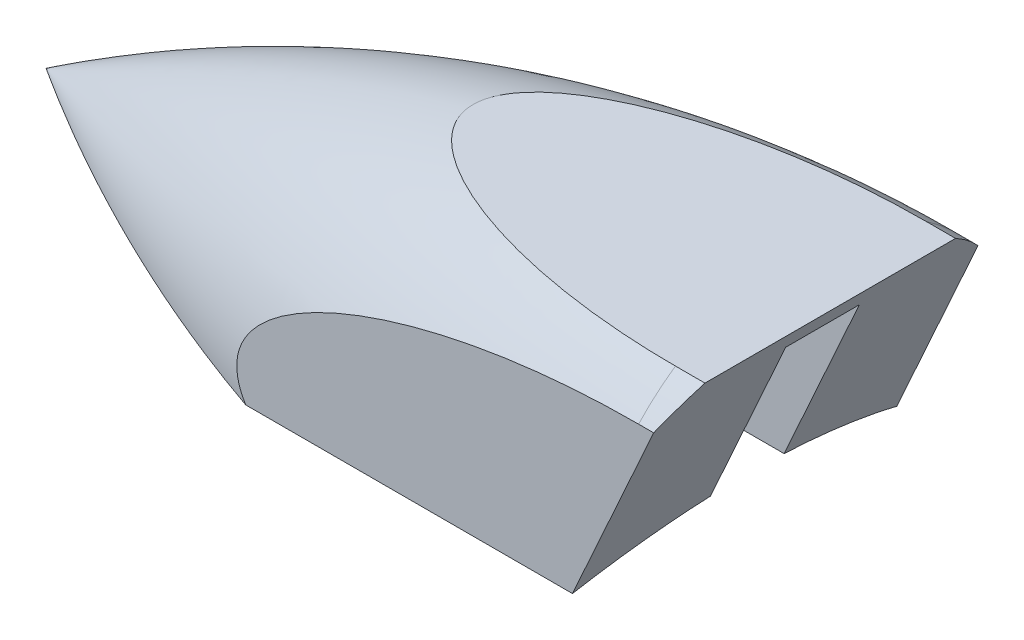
ISO-10303-21;
HEADER;
FILE_DESCRIPTION(('STEP AP214'),'2;1');
FILE_NAME('part.step','',(''),(''),'','','');
FILE_SCHEMA(('AUTOMOTIVE_DESIGN { 1 0 10303 214 1 1 1 1 }'));
ENDSEC;
DATA;
#1=APPLICATION_CONTEXT('core data for automotive mechanical design processes');
#2=APPLICATION_PROTOCOL_DEFINITION('international standard','automotive_design',2000,#1);
#3=PRODUCT_CONTEXT('',#1,'mechanical');
#4=PRODUCT('Part','Part','',(#3));
#5=PRODUCT_RELATED_PRODUCT_CATEGORY('part','',(#4));
#6=PRODUCT_DEFINITION_FORMATION('','',#4);
#7=PRODUCT_DEFINITION_CONTEXT('part definition',#1,'design');
#8=PRODUCT_DEFINITION('design','',#6,#7);
#9=PRODUCT_DEFINITION_SHAPE('','',#8);
#10=(LENGTH_UNIT() NAMED_UNIT(*) SI_UNIT(.MILLI.,.METRE.));
#11=(NAMED_UNIT(*) PLANE_ANGLE_UNIT() SI_UNIT($,.RADIAN.));
#12=(NAMED_UNIT(*) SI_UNIT($,.STERADIAN.) SOLID_ANGLE_UNIT());
#13=UNCERTAINTY_MEASURE_WITH_UNIT(LENGTH_MEASURE(1.E-05),#10,'distance_accuracy_value','');
#14=(GEOMETRIC_REPRESENTATION_CONTEXT(3) GLOBAL_UNCERTAINTY_ASSIGNED_CONTEXT((#13)) GLOBAL_UNIT_ASSIGNED_CONTEXT((#10,
#11,#12)) REPRESENTATION_CONTEXT('',''));
#15=CARTESIAN_POINT('',(0.,0.,0.));
#16=DIRECTION('',(0.,0.,1.));
#17=DIRECTION('',(1.,0.,0.));
#18=AXIS2_PLACEMENT_3D('',#15,#16,#17);
#19=CARTESIAN_POINT('',(2.54,0.,0.));
#20=DIRECTION('',(-1.,0.,0.));
#21=DIRECTION('',(0.,0.,1.));
#22=AXIS2_PLACEMENT_3D('',#19,#20,#21);
#23=CYLINDRICAL_SURFACE('',#22,19.05);
#24=DIRECTION('',(1.,0.,0.));
#25=VECTOR('',#24,1.);
#26=CARTESIAN_POINT('',(-65.0232843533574,12.9515095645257,13.97));
#27=LINE('',#26,#25);
#28=CARTESIAN_POINT('',(-2.91433543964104E-13,12.9515095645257,13.97));
#29=VERTEX_POINT('',#28);
#30=CARTESIAN_POINT('',(1.30003580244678,12.9515095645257,13.97));
#31=VERTEX_POINT('',#30);
#32=EDGE_CURVE('E162',#29,#31,#27,.T.);
#33=ORIENTED_EDGE('',*,*,#32,.T.);
#34=CARTESIAN_POINT('',(-4.55106086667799,0.,0.));
#35=DIRECTION('',(-0.91131706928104,0.411705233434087,0.));
#36=DIRECTION('',(-0.411705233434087,-0.91131706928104,0.));
#37=AXIS2_PLACEMENT_3D('',#34,#35,#36);
#38=ELLIPSE('',#37,20.9038112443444,19.05);
#39=CARTESIAN_POINT('',(2.54,15.6961930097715,10.795));
#40=VERTEX_POINT('',#39);
#41=EDGE_CURVE('E142',#31,#40,#38,.T.);
#42=ORIENTED_EDGE('',*,*,#41,.T.);
#43=DIRECTION('',(1.,0.,0.));
#44=VECTOR('',#43,1.);
#45=CARTESIAN_POINT('',(-65.0232843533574,15.6961930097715,10.795));
#46=LINE('',#45,#44);
#47=CARTESIAN_POINT('',(0.,15.6961930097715,10.795));
#48=VERTEX_POINT('',#47);
#49=EDGE_CURVE('E322',#48,#40,#46,.T.);
#50=ORIENTED_EDGE('',*,*,#49,.F.);
#51=CARTESIAN_POINT('',(0.,0.,0.));
#52=DIRECTION('',(1.,0.,0.));
#53=DIRECTION('',(0.,1.,0.));
#54=AXIS2_PLACEMENT_3D('',#51,#52,#53);
#55=CIRCLE('',#54,19.05);
#56=EDGE_CURVE('E165',#48,#29,#55,.T.);
#57=ORIENTED_EDGE('',*,*,#56,.T.);
#58=EDGE_LOOP('',(#33,#42,#50,#57));
#59=FACE_BOUND('',#58,.T.);
#60=ADVANCED_FACE('F31',(#59),#23,.T.);
#61=DIRECTION('',(1.,0.,0.));
#62=VECTOR('',#61,1.);
#63=CARTESIAN_POINT('',(-65.0232843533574,15.6961930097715,-10.795));
#64=LINE('',#63,#62);
#65=CARTESIAN_POINT('',(0.,15.6961930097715,-10.795));
#66=VERTEX_POINT('',#65);
#67=CARTESIAN_POINT('',(2.54,15.6961930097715,-10.795));
#68=VERTEX_POINT('',#67);
#69=EDGE_CURVE('E174',#66,#68,#64,.T.);
#70=ORIENTED_EDGE('',*,*,#69,.T.);
#71=CARTESIAN_POINT('',(-4.55106086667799,0.,0.));
#72=DIRECTION('',(-0.91131706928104,0.411705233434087,0.));
#73=DIRECTION('',(-0.411705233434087,-0.91131706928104,0.));
#74=AXIS2_PLACEMENT_3D('',#71,#72,#73);
#75=ELLIPSE('',#74,20.9038112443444,19.05);
#76=CARTESIAN_POINT('',(1.30003580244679,12.9515095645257,-13.97));
#77=VERTEX_POINT('',#76);
#78=EDGE_CURVE('E156',#68,#77,#75,.T.);
#79=ORIENTED_EDGE('',*,*,#78,.T.);
#80=DIRECTION('',(1.,0.,0.));
#81=VECTOR('',#80,1.);
#82=CARTESIAN_POINT('',(-65.0232843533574,12.9515095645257,-13.97));
#83=LINE('',#82,#81);
#84=CARTESIAN_POINT('',(-3.05311331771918E-13,12.9515095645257,-13.97));
#85=VERTEX_POINT('',#84);
#86=EDGE_CURVE('E168',#85,#77,#83,.T.);
#87=ORIENTED_EDGE('',*,*,#86,.F.);
#88=EDGE_CURVE('E175',#85,#66,#55,.T.);
#89=ORIENTED_EDGE('',*,*,#88,.T.);
#90=EDGE_LOOP('',(#70,#79,#87,#89));
#91=FACE_BOUND('',#90,.T.);
#92=ADVANCED_FACE('F33',(#91),#23,.T.);
#93=CARTESIAN_POINT('',(0.,-101.446850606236,0.));
#94=DIRECTION('',(0.,0.,-1.));
#95=DIRECTION('',(0.,1.,0.));
#96=AXIS2_PLACEMENT_3D('',#93,#94,#95);
#97=CIRCLE('',#96,120.496850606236);
#98=TRIMMED_CURVE('',#97,(PARAMETER_VALUE(-0.569993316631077)),
(PARAMETER_VALUE(0.569993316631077)),.T.,.PARAMETER.);
#99=CARTESIAN_POINT('',(0.,0.,0.));
#100=DIRECTION('',(1.,0.,0.));
#101=AXIS1_PLACEMENT('',#99,#100);
#102=SURFACE_OF_REVOLUTION('',#98,#101);
#103=CARTESIAN_POINT('',(-28.2311589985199,15.6961930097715,0.));
#104=CARTESIAN_POINT('',(-28.2311637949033,15.6961930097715,0.124324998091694));
#105=CARTESIAN_POINT('',(-28.2250086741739,15.6961930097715,0.248625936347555));
#106=CARTESIAN_POINT('',(-28.2006515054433,15.6961930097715,0.496058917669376));
#107=CARTESIAN_POINT('',(-28.1824456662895,15.6961930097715,0.61919058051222));
#108=CARTESIAN_POINT('',(-28.1105048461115,15.6961930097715,0.985505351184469));
#109=CARTESIAN_POINT('',(-28.0394479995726,15.6961930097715,1.22540887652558));
#110=CARTESIAN_POINT('',(-27.8376268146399,15.6961930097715,1.74608543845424));
#111=CARTESIAN_POINT('',(-27.6965925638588,15.6961930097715,2.02275224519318));
#112=CARTESIAN_POINT('',(-27.3727061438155,15.6961930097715,2.55029773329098));
#113=CARTESIAN_POINT('',(-27.1897665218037,15.6961930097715,2.80112087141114));
#114=CARTESIAN_POINT('',(-26.8199944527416,15.6961930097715,3.24812680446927));
#115=CARTESIAN_POINT('',(-26.636585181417,15.6961930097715,3.44720728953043));
#116=CARTESIAN_POINT('',(-26.2533366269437,15.6961930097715,3.82902661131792));
#117=CARTESIAN_POINT('',(-26.0534841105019,15.6961930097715,4.0117520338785));
#118=CARTESIAN_POINT('',(-25.6410958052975,15.6961930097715,4.36312577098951));
#119=CARTESIAN_POINT('',(-25.4285322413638,15.6961930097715,4.53174117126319));
#120=CARTESIAN_POINT('',(-24.994040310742,15.6961930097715,4.85620341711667));
#121=CARTESIAN_POINT('',(-24.7721146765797,15.6961930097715,5.01205394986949));
#122=CARTESIAN_POINT('',(-24.2344643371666,15.6961930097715,5.37013753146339));
#123=CARTESIAN_POINT('',(-23.9153585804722,15.6961930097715,5.56728316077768));
#124=CARTESIAN_POINT('',(-23.2665960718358,15.6961930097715,5.94350629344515));
#125=CARTESIAN_POINT('',(-22.9369348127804,15.6961930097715,6.12257593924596));
#126=CARTESIAN_POINT('',(-22.2690974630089,15.6961930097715,6.46526380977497));
#127=CARTESIAN_POINT('',(-21.9309094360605,15.6961930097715,6.62885865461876));
#128=CARTESIAN_POINT('',(-21.2481703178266,15.6961930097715,6.94220137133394));
#129=CARTESIAN_POINT('',(-20.9036185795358,15.6961930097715,7.09194782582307));
#130=CARTESIAN_POINT('',(-20.2078953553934,15.6961930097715,7.37968050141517));
#131=CARTESIAN_POINT('',(-19.8567015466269,15.6961930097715,7.51761256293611));
#132=CARTESIAN_POINT('',(-19.1500885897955,15.6961930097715,7.78215133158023));
#133=CARTESIAN_POINT('',(-18.7946693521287,15.6961930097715,7.90875779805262));
#134=CARTESIAN_POINT('',(-17.7237564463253,15.6961930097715,8.27284637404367));
#135=CARTESIAN_POINT('',(-17.0029718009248,15.6961930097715,8.49485571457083));
#136=CARTESIAN_POINT('',(-15.5229978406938,15.6961930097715,8.91107725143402));
#137=CARTESIAN_POINT('',(-14.7634113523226,15.6961930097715,9.10385689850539));
#138=CARTESIAN_POINT('',(-13.2361923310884,15.6961930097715,9.45489754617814));
#139=CARTESIAN_POINT('',(-12.468558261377,15.6961930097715,9.61315182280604));
#140=CARTESIAN_POINT('',(-10.9266868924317,15.6961930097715,9.8980597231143));
#141=CARTESIAN_POINT('',(-10.1524437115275,15.6961930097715,10.0246812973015));
#142=CARTESIAN_POINT('',(-8.59973657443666,15.6961930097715,10.2480649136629));
#143=CARTESIAN_POINT('',(-7.82127290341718,15.6961930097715,10.3448289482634));
#144=CARTESIAN_POINT('',(-6.2625763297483,15.6961930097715,10.5097135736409));
#145=CARTESIAN_POINT('',(-5.48234816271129,15.6961930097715,10.57787915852));
#146=CARTESIAN_POINT('',(-3.91996570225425,15.6961930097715,10.6866512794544));
#147=CARTESIAN_POINT('',(-3.13781137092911,15.6961930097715,10.7272572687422));
#148=CARTESIAN_POINT('',(-1.57305190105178,15.6961930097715,10.7813780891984));
#149=CARTESIAN_POINT('',(-0.790447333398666,15.6961930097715,10.7949095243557));
#150=CARTESIAN_POINT('',(0.774750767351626,15.6961930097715,10.7950895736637));
#151=CARTESIAN_POINT('',(1.55734430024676,15.6961930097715,10.7817388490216));
#152=CARTESIAN_POINT('',(3.01564101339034,15.6961930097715,10.7316372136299));
#153=CARTESIAN_POINT('',(3.69146340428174,15.6961930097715,10.6983010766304));
#154=CARTESIAN_POINT('',(5.04178492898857,15.6961930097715,10.6111174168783));
#155=CARTESIAN_POINT('',(5.71628407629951,15.6961930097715,10.5572701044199));
#156=CARTESIAN_POINT('',(7.06363618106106,15.6961930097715,10.4285288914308));
#157=CARTESIAN_POINT('',(7.73648808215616,15.6961930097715,10.3536239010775));
#158=CARTESIAN_POINT('',(9.07941261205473,15.6961930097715,10.1820337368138));
#159=CARTESIAN_POINT('',(9.74948526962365,15.6961930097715,10.0853487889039));
#160=CARTESIAN_POINT('',(11.0879619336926,15.6961930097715,9.86882360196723));
#161=CARTESIAN_POINT('',(11.7563548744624,15.6961930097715,9.74891465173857));
#162=CARTESIAN_POINT('',(13.0882867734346,15.6961930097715,9.4846726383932));
#163=CARTESIAN_POINT('',(13.75182594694,15.6961930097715,9.34034066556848));
#164=CARTESIAN_POINT('',(15.0719758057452,15.6961930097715,9.02539187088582));
#165=CARTESIAN_POINT('',(15.7285927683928,15.6961930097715,8.85480153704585));
#166=CARTESIAN_POINT('',(17.0334539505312,15.6961930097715,8.48446977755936));
#167=CARTESIAN_POINT('',(17.6816997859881,15.6961930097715,8.28473407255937));
#168=CARTESIAN_POINT('',(18.9710084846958,15.6961930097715,7.85083929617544));
#169=CARTESIAN_POINT('',(19.6120062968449,15.6961930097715,7.61648385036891));
#170=CARTESIAN_POINT('',(20.5619850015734,15.6961930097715,7.23518457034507));
#171=CARTESIAN_POINT('',(20.8769289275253,15.6961930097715,7.10302673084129));
#172=CARTESIAN_POINT('',(21.5020030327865,15.6961930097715,6.8277503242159));
#173=CARTESIAN_POINT('',(21.8121333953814,15.6961930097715,6.6846321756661));
#174=CARTESIAN_POINT('',(22.423933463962,15.6961930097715,6.38740634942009));
#175=CARTESIAN_POINT('',(22.725651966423,15.6961930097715,6.23339949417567));
#176=CARTESIAN_POINT('',(23.3218636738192,15.6961930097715,5.91175191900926));
#177=CARTESIAN_POINT('',(23.6163552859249,15.6961930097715,5.74410822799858));
#178=CARTESIAN_POINT('',(24.1952780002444,15.6961930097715,5.39363296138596));
#179=CARTESIAN_POINT('',(24.4797308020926,15.6961930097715,5.21083742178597));
#180=CARTESIAN_POINT('',(25.0361658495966,15.6961930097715,4.82728687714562));
#181=CARTESIAN_POINT('',(25.3081560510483,15.6961930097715,4.62654357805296));
#182=CARTESIAN_POINT('',(25.7242085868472,15.6961930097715,4.29285483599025));
#183=CARTESIAN_POINT('',(25.873921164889,15.6961930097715,4.16694601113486));
#184=CARTESIAN_POINT('',(26.1664295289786,15.6961930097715,3.90724832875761));
#185=CARTESIAN_POINT('',(26.3092243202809,15.6961930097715,3.77345834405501));
#186=CARTESIAN_POINT('',(26.5861672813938,15.6961930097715,3.49732405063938));
#187=CARTESIAN_POINT('',(26.7203210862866,15.6961930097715,3.35498543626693));
#188=CARTESIAN_POINT('',(26.9778967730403,15.6961930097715,3.06096774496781));
#189=CARTESIAN_POINT('',(27.1013223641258,15.6961930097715,2.90929192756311));
#190=CARTESIAN_POINT('',(27.3835789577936,15.6961930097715,2.53040264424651));
#191=CARTESIAN_POINT('',(27.5357082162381,15.6961930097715,2.29806733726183));
#192=CARTESIAN_POINT('',(27.8026747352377,15.6961930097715,1.8127920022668));
#193=CARTESIAN_POINT('',(27.9175769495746,15.6961930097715,1.55988883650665));
#194=CARTESIAN_POINT('',(28.0801059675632,15.6961930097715,1.08868618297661));
#195=CARTESIAN_POINT('',(28.1365569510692,15.6961930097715,0.873474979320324));
#196=CARTESIAN_POINT('',(28.2122541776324,15.6961930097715,0.436635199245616));
#197=CARTESIAN_POINT('',(28.2315387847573,15.6961930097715,0.2150134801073));
#198=CARTESIAN_POINT('',(28.2307672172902,15.6961930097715,-0.228489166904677));
#199=CARTESIAN_POINT('',(28.2106529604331,15.6961930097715,-0.450369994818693));
#200=CARTESIAN_POINT('',(28.1332810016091,15.6961930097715,-0.88757248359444));
#201=CARTESIAN_POINT('',(28.0759857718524,15.6961930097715,-1.10288728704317));
#202=CARTESIAN_POINT('',(27.9068371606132,15.6961930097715,-1.58787938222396));
#203=CARTESIAN_POINT('',(27.7835281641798,15.6961930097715,-1.85351199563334));
#204=CARTESIAN_POINT('',(27.4965460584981,15.6961930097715,-2.36193111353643));
#205=CARTESIAN_POINT('',(27.3327815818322,15.6961930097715,-2.6046641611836));
#206=CARTESIAN_POINT('',(27.0025851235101,15.6961930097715,-3.03416924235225));
#207=CARTESIAN_POINT('',(26.8399827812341,15.6961930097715,-3.22395224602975));
#208=CARTESIAN_POINT('',(26.4989782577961,15.6961930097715,-3.58888243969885));
#209=CARTESIAN_POINT('',(26.3205639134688,15.6961930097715,-3.76401815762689));
#210=CARTESIAN_POINT('',(25.9513838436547,15.6961930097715,-4.10154076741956));
#211=CARTESIAN_POINT('',(25.7605896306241,15.6961930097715,-4.26389620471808));
#212=CARTESIAN_POINT('',(25.3697752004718,15.6961930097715,-4.57689500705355));
#213=CARTESIAN_POINT('',(25.1697574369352,15.6961930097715,-4.72754145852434));
#214=CARTESIAN_POINT('',(24.6919094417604,15.6961930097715,-5.06887673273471));
#215=CARTESIAN_POINT('',(24.4111007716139,15.6961930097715,-5.25538611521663));
#216=CARTESIAN_POINT('',(23.8394575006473,15.6961930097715,-5.61246103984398));
#217=CARTESIAN_POINT('',(23.5486187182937,15.6961930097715,-5.78301981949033));
#218=CARTESIAN_POINT('',(22.958826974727,15.6961930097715,-6.11044120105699));
#219=CARTESIAN_POINT('',(22.6598630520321,15.6961930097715,-6.26728396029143));
#220=CARTESIAN_POINT('',(22.0557690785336,15.6961930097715,-6.56867481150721));
#221=CARTESIAN_POINT('',(21.750637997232,15.6961930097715,-6.71322082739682));
#222=CARTESIAN_POINT('',(21.1342776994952,15.6961930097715,-6.99181533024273));
#223=CARTESIAN_POINT('',(20.8230301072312,15.6961930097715,-7.12582302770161));
#224=CARTESIAN_POINT('',(20.1963924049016,15.6961930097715,-7.38380401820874));
#225=CARTESIAN_POINT('',(19.8810019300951,15.6961930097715,-7.50777642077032));
#226=CARTESIAN_POINT('',(18.9302268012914,15.6961930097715,-7.865746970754));
#227=CARTESIAN_POINT('',(18.2896621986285,15.6961930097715,-8.08605423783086));
#228=CARTESIAN_POINT('',(16.9561366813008,15.6961930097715,-8.50867985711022));
#229=CARTESIAN_POINT('',(16.2625052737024,15.6961930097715,-8.70885514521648));
#230=CARTESIAN_POINT('',(14.8668027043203,15.6961930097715,-9.07765776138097));
#231=CARTESIAN_POINT('',(14.1647298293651,15.6961930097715,-9.24627856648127));
#232=CARTESIAN_POINT('',(12.7536690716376,15.6961930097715,-9.55496795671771));
#233=CARTESIAN_POINT('',(12.044675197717,15.6961930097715,-9.69500897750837));
#234=CARTESIAN_POINT('',(10.621924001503,15.6961930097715,-9.94840060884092));
#235=CARTESIAN_POINT('',(9.90816646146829,15.6961930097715,-10.0617499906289));
#236=CARTESIAN_POINT('',(8.47584178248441,15.6961930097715,-10.2633939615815));
#237=CARTESIAN_POINT('',(7.75726834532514,15.6961930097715,-10.3516436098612));
#238=CARTESIAN_POINT('',(6.31755522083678,15.6961930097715,-10.5038534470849));
#239=CARTESIAN_POINT('',(5.59641550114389,15.6961930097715,-10.5678133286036));
#240=CARTESIAN_POINT('',(4.15284939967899,15.6961930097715,-10.6721063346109));
#241=CARTESIAN_POINT('',(3.43042398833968,15.6961930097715,-10.7124529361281));
#242=CARTESIAN_POINT('',(1.98465354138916,15.6961930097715,-10.7699904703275));
#243=CARTESIAN_POINT('',(1.26130849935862,15.6961930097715,-10.787181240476));
#244=CARTESIAN_POINT('',(-0.276622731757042,15.6961930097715,-10.7992989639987));
#245=CARTESIAN_POINT('',(-1.09123484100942,15.6961930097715,-10.7911516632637));
#246=CARTESIAN_POINT('',(-2.71966398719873,15.6961930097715,-10.7456274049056));
#247=CARTESIAN_POINT('',(-3.53348100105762,15.6961930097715,-10.7082496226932));
#248=CARTESIAN_POINT('',(-5.1599304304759,15.6961930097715,-10.6037349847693));
#249=CARTESIAN_POINT('',(-5.9725611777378,15.6961930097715,-10.5365720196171));
#250=CARTESIAN_POINT('',(-7.59468669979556,15.6961930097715,-10.3715705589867));
#251=CARTESIAN_POINT('',(-8.40418159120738,15.6961930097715,-10.2737332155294));
#252=CARTESIAN_POINT('',(-10.0135088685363,15.6961930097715,-10.0466645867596));
#253=CARTESIAN_POINT('',(-10.813369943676,15.6961930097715,-9.91763794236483));
#254=CARTESIAN_POINT('',(-12.4070333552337,15.6961930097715,-9.62573924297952));
#255=CARTESIAN_POINT('',(-13.2008348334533,15.6961930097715,-9.46286248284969));
#256=CARTESIAN_POINT('',(-14.7789075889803,15.6961930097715,-9.10045516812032));
#257=CARTESIAN_POINT('',(-15.5631912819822,15.6961930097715,-8.90097947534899));
#258=CARTESIAN_POINT('',(-16.7306635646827,15.6961930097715,-8.57075785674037));
#259=CARTESIAN_POINT('',(-17.1182777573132,15.6961930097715,-8.45553337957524));
#260=CARTESIAN_POINT('',(-17.8900058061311,15.6961930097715,-8.21393543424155));
#261=CARTESIAN_POINT('',(-18.2741199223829,15.6961930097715,-8.08756280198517));
#262=CARTESIAN_POINT('',(-18.9779898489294,15.6961930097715,-7.84355610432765));
#263=CARTESIAN_POINT('',(-19.2983550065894,15.6961930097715,-7.72767980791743));
#264=CARTESIAN_POINT('',(-19.9355620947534,15.6961930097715,-7.48660403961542));
#265=CARTESIAN_POINT('',(-20.2524040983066,15.6961930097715,-7.3614047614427));
#266=CARTESIAN_POINT('',(-20.8826707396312,15.6961930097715,-7.10047451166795));
#267=CARTESIAN_POINT('',(-21.196084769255,15.6961930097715,-6.96471782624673));
#268=CARTESIAN_POINT('',(-21.817753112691,15.6961930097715,-6.68185369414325));
#269=CARTESIAN_POINT('',(-22.1260075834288,15.6961930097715,-6.53474659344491));
#270=CARTESIAN_POINT('',(-22.7759551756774,15.6961930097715,-6.20777949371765));
#271=CARTESIAN_POINT('',(-23.1167648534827,15.6961930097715,-6.02615021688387));
#272=CARTESIAN_POINT('',(-23.7879117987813,15.6961930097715,-5.64397697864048));
#273=CARTESIAN_POINT('',(-24.1182440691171,15.6961930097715,-5.44342416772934));
#274=CARTESIAN_POINT('',(-24.7633491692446,15.6961930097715,-5.0208380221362));
#275=CARTESIAN_POINT('',(-25.0781725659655,15.6961930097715,-4.79888259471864));
#276=CARTESIAN_POINT('',(-25.6873466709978,15.6961930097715,-4.32872380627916));
#277=CARTESIAN_POINT('',(-25.9817224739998,15.6961930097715,-4.08055359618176));
#278=CARTESIAN_POINT('',(-26.4866288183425,15.6961930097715,-3.60330609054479));
#279=CARTESIAN_POINT('',(-26.7023718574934,15.6961930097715,-3.3797993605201));
#280=CARTESIAN_POINT('',(-27.1063510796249,15.6961930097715,-2.90866306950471));
#281=CARTESIAN_POINT('',(-27.2945918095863,15.6961930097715,-2.66103750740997));
#282=CARTESIAN_POINT('',(-27.6072468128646,15.6961930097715,-2.17690057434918));
#283=CARTESIAN_POINT('',(-27.7369367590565,15.6961930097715,-1.94385062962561));
#284=CARTESIAN_POINT('',(-27.9564718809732,15.6961930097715,-1.45974043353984));
#285=CARTESIAN_POINT('',(-28.0464248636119,15.6961930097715,-1.20873108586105));
#286=CARTESIAN_POINT('',(-28.1505400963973,15.6961930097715,-0.796108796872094));
#287=CARTESIAN_POINT('',(-28.180608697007,15.6961930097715,-0.638440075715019));
#288=CARTESIAN_POINT('',(-28.2209149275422,15.6961930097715,-0.320500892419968));
#289=CARTESIAN_POINT('',(-28.2311528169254,15.6961930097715,-0.160230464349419));
#290=CARTESIAN_POINT('',(-28.2311589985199,15.6961930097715,0.));
#291=B_SPLINE_CURVE_WITH_KNOTS('',3,(#103,#104,#105,#106,#107,#108,#109,#110,#111,#112,#113,
#114,#115,#116,#117,#118,#119,#120,#121,#122,#123,#124,#125,#126,#127,#128,#129,#130,#131,#132,
#133,#134,#135,#136,#137,#138,#139,#140,#141,#142,#143,#144,#145,#146,#147,#148,#149,#150,#151,
#152,#153,#154,#155,#156,#157,#158,#159,#160,#161,#162,#163,#164,#165,#166,#167,#168,#169,#170,
#171,#172,#173,#174,#175,#176,#177,#178,#179,#180,#181,#182,#183,#184,#185,#186,#187,#188,#189,
#190,#191,#192,#193,#194,#195,#196,#197,#198,#199,#200,#201,#202,#203,#204,#205,#206,#207,#208,
#209,#210,#211,#212,#213,#214,#215,#216,#217,#218,#219,#220,#221,#222,#223,#224,#225,#226,#227,
#228,#229,#230,#231,#232,#233,#234,#235,#236,#237,#238,#239,#240,#241,#242,#243,#244,#245,#246,
#247,#248,#249,#250,#251,#252,#253,#254,#255,#256,#257,#258,#259,#260,#261,#262,#263,#264,#265,
#266,#267,#268,#269,#270,#271,#272,#273,#274,#275,#276,#277,#278,#279,#280,#281,#282,#283,#284,
#285,#286,#287,#288,#289,#290),.UNSPECIFIED.,.T.,.F.,(4,2,2,2,2,2,2,2,2,2,2,2,2,2,2,2,2,2,2,2,2,
2,2,2,2,2,2,2,2,2,2,2,2,2,2,2,2,2,2,2,2,2,2,2,2,2,2,2,2,2,2,2,2,2,2,2,2,2,2,2,2,2,2,2,2,2,2,2,2,
2,2,2,2,2,2,2,2,2,2,2,2,2,2,2,2,2,2,2,2,2,2,2,2,4),(0.,0.372773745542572,0.745664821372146,
1.4920350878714,2.41849946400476,3.34691519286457,4.15782551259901,4.96939494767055,
5.78280760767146,6.59598447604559,7.72050071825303,8.84550369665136,9.97218009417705,
11.0989716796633,12.2306793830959,13.3624111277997,15.6238194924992,17.9739627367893,
20.3245632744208,22.6775358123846,25.0303512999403,27.3794510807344,29.7285974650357,
32.076302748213,34.4239502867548,36.4535849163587,38.4831987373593,40.5138834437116,
42.5445470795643,44.581313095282,46.6179882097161,48.6526221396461,50.6868572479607,
52.7331088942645,53.7575877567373,54.7820275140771,55.7979835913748,56.8141616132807,
57.8279886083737,58.8411591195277,59.4277891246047,60.0145032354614,60.6008307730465,
61.1869547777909,62.0175224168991,62.8466329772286,63.5112639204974,64.1752084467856,
64.8401325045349,65.5057287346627,66.3793745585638,67.255011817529,68.0036868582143,
68.7529428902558,69.5039887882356,70.2548360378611,71.2654683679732,72.2765272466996,
73.2890254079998,74.3016941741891,75.3181071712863,76.3346102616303,78.3657281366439,
80.5307330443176,82.6961850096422,84.8637157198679,87.0313461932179,89.2028337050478,
91.3743486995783,93.5446231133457,95.7149127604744,98.1583400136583,100.601836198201,
103.04747857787,105.493029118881,107.922949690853,110.353208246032,112.779853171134,
113.99285258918,115.205761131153,116.22766538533,117.24954841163,118.27400338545,
119.29842714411,120.456484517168,121.615086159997,122.769619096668,123.922709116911,
124.853081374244,125.783299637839,126.580698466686,127.375920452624,127.856358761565,
128.336790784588),.UNSPECIFIED.);
#292=EDGE_CURVE('E256',#66,#48,#291,.T.);
#293=ORIENTED_EDGE('',*,*,#292,.F.);
#294=ORIENTED_EDGE('',*,*,#88,.F.);
#295=CARTESIAN_POINT('',(-32.0389324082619,4.61488317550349,-13.97));
#296=CARTESIAN_POINT('',(-32.2970996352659,4.3878648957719,-13.97));
#297=CARTESIAN_POINT('',(-32.5464303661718,4.15067825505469,-13.97));
#298=CARTESIAN_POINT('',(-33.0207385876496,3.6521692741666,-13.97));
#299=CARTESIAN_POINT('',(-33.2456816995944,3.39081380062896,-13.97));
#300=CARTESIAN_POINT('',(-33.6626840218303,2.83713046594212,-13.97));
#301=CARTESIAN_POINT('',(-33.8543149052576,2.54446771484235,-13.97));
#302=CARTESIAN_POINT('',(-34.1015670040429,2.08432469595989,-13.97));
#303=CARTESIAN_POINT('',(-34.1772316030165,1.92758039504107,-13.97));
#304=CARTESIAN_POINT('',(-34.3127910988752,1.60746448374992,-13.97));
#305=CARTESIAN_POINT('',(-34.3726946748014,1.44409657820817,-13.97));
#306=CARTESIAN_POINT('',(-34.4945981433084,1.04500784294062,-13.97));
#307=CARTESIAN_POINT('',(-34.5478399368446,0.806500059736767,-13.97));
#308=CARTESIAN_POINT('',(-34.6129256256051,0.323996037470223,-13.97));
#309=CARTESIAN_POINT('',(-34.6248053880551,0.08000473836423,-13.97));
#310=CARTESIAN_POINT('',(-34.6058719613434,-0.406324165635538,-13.97));
#311=CARTESIAN_POINT('',(-34.5750519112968,-0.648661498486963,-13.97));
#312=CARTESIAN_POINT('',(-34.4741914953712,-1.12503030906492,-13.97));
#313=CARTESIAN_POINT('',(-34.4041088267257,-1.35905253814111,-13.97));
#314=CARTESIAN_POINT('',(-34.1970877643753,-1.90406209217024,-13.97));
#315=CARTESIAN_POINT('',(-34.0446949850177,-2.2091131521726,-13.97));
#316=CARTESIAN_POINT('',(-33.6943739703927,-2.79176451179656,-13.97));
#317=CARTESIAN_POINT('',(-33.4963297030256,-3.0692922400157,-13.97));
#318=CARTESIAN_POINT('',(-33.0905242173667,-3.57166905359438,-13.97));
#319=CARTESIAN_POINT('',(-32.8857796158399,-3.79900658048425,-13.97));
#320=CARTESIAN_POINT('',(-32.4575746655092,-4.23548573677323,-13.97));
#321=CARTESIAN_POINT('',(-32.2340981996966,-4.44461137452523,-13.97));
#322=CARTESIAN_POINT('',(-31.7727410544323,-4.84738336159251,-13.97));
#323=CARTESIAN_POINT('',(-31.5348254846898,-5.0409893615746,-13.97));
#324=CARTESIAN_POINT('',(-31.0484452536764,-5.41417930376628,-13.97));
#325=CARTESIAN_POINT('',(-30.7999840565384,-5.59376779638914,-13.97));
#326=CARTESIAN_POINT('',(-30.1823595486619,-6.01796257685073,-13.97));
#327=CARTESIAN_POINT('',(-29.8086645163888,-6.25595842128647,-13.97));
#328=CARTESIAN_POINT('',(-29.0484944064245,-6.71073623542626,-13.97));
#329=CARTESIAN_POINT('',(-28.6620135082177,-6.92750836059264,-13.97));
#330=CARTESIAN_POINT('',(-27.8787367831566,-7.34312686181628,-13.97));
#331=CARTESIAN_POINT('',(-27.4819245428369,-7.54194214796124,-13.97));
#332=CARTESIAN_POINT('',(-26.6807655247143,-7.92350223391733,-13.97));
#333=CARTESIAN_POINT('',(-26.2764199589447,-8.10624959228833,-13.97));
#334=CARTESIAN_POINT('',(-25.4601012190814,-8.45811482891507,-13.97));
#335=CARTESIAN_POINT('',(-25.0481054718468,-8.62718014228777,-13.97));
#336=CARTESIAN_POINT('',(-24.2190228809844,-8.95231322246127,-13.97));
#337=CARTESIAN_POINT('',(-23.8019359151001,-9.10838067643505,-13.97));
#338=CARTESIAN_POINT('',(-22.963885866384,-9.4084660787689,-13.97));
#339=CARTESIAN_POINT('',(-22.5429266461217,-9.55249483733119,-13.97));
#340=CARTESIAN_POINT('',(-21.6973854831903,-9.82952192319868,-13.97));
#341=CARTESIAN_POINT('',(-21.2728033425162,-9.96251964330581,-13.97));
#342=CARTESIAN_POINT('',(-19.9494884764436,-10.3595282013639,-13.97));
#343=CARTESIAN_POINT('',(-19.0454079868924,-10.6058577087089,-13.97));
#344=CARTESIAN_POINT('',(-17.227035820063,-11.0576422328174,-13.97));
#345=CARTESIAN_POINT('',(-16.3127422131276,-11.2630893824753,-13.97));
#346=CARTESIAN_POINT('',(-14.4755635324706,-11.6364270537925,-13.97));
#347=CARTESIAN_POINT('',(-13.5526705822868,-11.8042786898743,-13.97));
#348=CARTESIAN_POINT('',(-11.7012001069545,-12.1043380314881,-13.97));
#349=CARTESIAN_POINT('',(-10.7726229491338,-12.2365480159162,-13.97));
#350=CARTESIAN_POINT('',(-8.90887253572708,-12.4671351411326,-13.97));
#351=CARTESIAN_POINT('',(-7.9736884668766,-12.5654245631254,-13.97));
#352=CARTESIAN_POINT('',(-6.10041771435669,-12.7287095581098,-13.97));
#353=CARTESIAN_POINT('',(-5.16233099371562,-12.7937047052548,-13.97));
#354=CARTESIAN_POINT('',(-3.28508549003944,-12.8909864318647,-13.97));
#355=CARTESIAN_POINT('',(-2.34592781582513,-12.9232944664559,-13.97));
#356=CARTESIAN_POINT('',(-0.467054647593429,-12.9555702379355,-13.97));
#357=CARTESIAN_POINT('',(0.472660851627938,-12.9555376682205,-13.97));
#358=CARTESIAN_POINT('',(2.44039678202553,-12.9216014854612,-13.97));
#359=CARTESIAN_POINT('',(3.46836391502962,-12.8844949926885,-13.97));
#360=CARTESIAN_POINT('',(5.52216612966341,-12.7711340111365,-13.97));
#361=CARTESIAN_POINT('',(6.54800114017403,-12.694878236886,-13.97));
#362=CARTESIAN_POINT('',(8.5972648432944,-12.5022182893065,-13.97));
#363=CARTESIAN_POINT('',(9.62068880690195,-12.3857631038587,-13.97));
#364=CARTESIAN_POINT('',(11.1515248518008,-12.1798892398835,-13.97));
#365=CARTESIAN_POINT('',(11.6610717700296,-12.1060687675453,-13.97));
#366=CARTESIAN_POINT('',(12.6785634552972,-11.9477514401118,-13.97));
#367=CARTESIAN_POINT('',(13.1865080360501,-11.8632533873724,-13.97));
#368=CARTESIAN_POINT('',(14.6995543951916,-11.5947038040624,-13.97));
#369=CARTESIAN_POINT('',(15.701848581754,-11.3945326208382,-13.97));
#370=CARTESIAN_POINT('',(17.6960258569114,-10.9477279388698,-13.97));
#371=CARTESIAN_POINT('',(18.6879100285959,-10.7010993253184,-13.97));
#372=CARTESIAN_POINT('',(20.16403063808,-10.2927346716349,-13.97));
#373=CARTESIAN_POINT('',(20.653665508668,-10.1503611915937,-13.97));
#374=CARTESIAN_POINT('',(21.6287107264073,-9.85185157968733,-13.97));
#375=CARTESIAN_POINT('',(22.1141213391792,-9.69571632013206,-13.97));
#376=CARTESIAN_POINT('',(23.0796773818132,-9.36864906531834,-13.97));
#377=CARTESIAN_POINT('',(23.5598252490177,-9.19772427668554,-13.97));
#378=CARTESIAN_POINT('',(24.5139849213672,-8.83959516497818,-13.97));
#379=CARTESIAN_POINT('',(24.9879975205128,-8.65239297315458,-13.97));
#380=CARTESIAN_POINT('',(25.6488413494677,-8.37653277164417,-13.97));
#381=CARTESIAN_POINT('',(25.8388564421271,-8.29545992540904,-13.97));
#382=CARTESIAN_POINT('',(26.2175079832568,-8.13016930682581,-13.97));
#383=CARTESIAN_POINT('',(26.4061444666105,-8.04595161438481,-13.97));
#384=CARTESIAN_POINT('',(26.9698124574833,-7.78831927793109,-13.97));
#385=CARTESIAN_POINT('',(27.3425921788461,-7.60992966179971,-13.97));
#386=CARTESIAN_POINT('',(28.0815618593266,-7.23781314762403,-13.97));
#387=CARTESIAN_POINT('',(28.4477338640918,-7.04405048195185,-13.97));
#388=CARTESIAN_POINT('',(29.1705090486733,-6.63943156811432,-13.97));
#389=CARTESIAN_POINT('',(29.5271137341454,-6.42857803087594,-13.97));
#390=CARTESIAN_POINT('',(30.1770035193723,-6.01895715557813,-13.97));
#391=CARTESIAN_POINT('',(30.4719717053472,-5.82287129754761,-13.97));
#392=CARTESIAN_POINT('',(31.0501876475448,-5.41371971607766,-13.97));
#393=CARTESIAN_POINT('',(31.3334302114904,-5.20064659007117,-13.97));
#394=CARTESIAN_POINT('',(31.8829012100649,-4.75563521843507,-13.97));
#395=CARTESIAN_POINT('',(32.149195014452,-4.52377842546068,-13.97));
#396=CARTESIAN_POINT('',(32.6597591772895,-4.03716972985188,-13.97));
#397=CARTESIAN_POINT('',(32.9040566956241,-3.78244685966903,-13.97));
#398=CARTESIAN_POINT('',(33.327219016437,-3.2863751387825,-13.97));
#399=CARTESIAN_POINT('',(33.5104026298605,-3.04874664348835,-13.97));
#400=CARTESIAN_POINT('',(33.845865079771,-2.55183540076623,-13.97));
#401=CARTESIAN_POINT('',(33.9981351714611,-2.29254655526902,-13.97));
#402=CARTESIAN_POINT('',(34.1953888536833,-1.88605829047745,-13.97));
#403=CARTESIAN_POINT('',(34.2562844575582,-1.74652186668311,-13.97));
#404=CARTESIAN_POINT('',(34.3653462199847,-1.46259557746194,-13.97));
#405=CARTESIAN_POINT('',(34.4135202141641,-1.31820876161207,-13.97));
#406=CARTESIAN_POINT('',(34.4954626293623,-1.02567573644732,-13.97));
#407=CARTESIAN_POINT('',(34.5292589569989,-0.877537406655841,-13.97));
#408=CARTESIAN_POINT('',(34.5812366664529,-0.578538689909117,-13.97));
#409=CARTESIAN_POINT('',(34.5994212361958,-0.427678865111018,-13.97));
#410=CARTESIAN_POINT('',(34.6181955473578,-0.143023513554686,-13.97));
#411=CARTESIAN_POINT('',(34.6206313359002,-0.00934763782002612,-13.97));
#412=CARTESIAN_POINT('',(34.6127201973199,0.257669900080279,-13.97));
#413=CARTESIAN_POINT('',(34.6023690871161,0.39101143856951,-13.97));
#414=CARTESIAN_POINT('',(34.5692213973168,0.656199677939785,-13.97));
#415=CARTESIAN_POINT('',(34.5464184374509,0.788045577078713,-13.97));
#416=CARTESIAN_POINT('',(34.4891191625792,1.04920158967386,-13.97));
#417=CARTESIAN_POINT('',(34.4546162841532,1.17851023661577,-13.97));
#418=CARTESIAN_POINT('',(34.3210107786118,1.60607848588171,-13.97));
#419=CARTESIAN_POINT('',(34.197555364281,1.89691228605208,-13.97));
#420=CARTESIAN_POINT('',(33.9061827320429,2.45501070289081,-13.97));
#421=CARTESIAN_POINT('',(33.738178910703,2.72222804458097,-13.97));
#422=CARTESIAN_POINT('',(33.3975799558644,3.19586727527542,-13.97));
#423=CARTESIAN_POINT('',(33.2292913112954,3.40545141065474,-13.97));
#424=CARTESIAN_POINT('',(32.8752215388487,3.80940804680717,-13.97));
#425=CARTESIAN_POINT('',(32.6894269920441,4.00376866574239,-13.97));
#426=CARTESIAN_POINT('',(32.304144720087,4.37926459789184,-13.97));
#427=CARTESIAN_POINT('',(32.10462426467,4.56036601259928,-13.97));
#428=CARTESIAN_POINT('',(31.6953309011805,4.91037458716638,-13.97));
#429=CARTESIAN_POINT('',(31.4855608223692,5.07928508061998,-13.97));
#430=CARTESIAN_POINT('',(30.9753048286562,5.46955310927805,-13.97));
#431=CARTESIAN_POINT('',(30.6710600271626,5.68598545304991,-13.97));
#432=CARTESIAN_POINT('',(30.0508230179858,6.10142674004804,-13.97));
#433=CARTESIAN_POINT('',(29.7348256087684,6.30042783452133,-13.97));
#434=CARTESIAN_POINT('',(29.093306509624,6.68361875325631,-13.97));
#435=CARTESIAN_POINT('',(28.7677698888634,6.86778345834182,-13.97));
#436=CARTESIAN_POINT('',(28.1096026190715,7.22277280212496,-13.97));
#437=CARTESIAN_POINT('',(27.7769730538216,7.3935994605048,-13.97));
#438=CARTESIAN_POINT('',(27.104436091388,7.72414198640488,-13.97));
#439=CARTESIAN_POINT('',(26.7645030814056,7.88380557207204,-13.97));
#440=CARTESIAN_POINT('',(26.0797963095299,8.19236042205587,-13.97));
#441=CARTESIAN_POINT('',(25.7350224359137,8.34125143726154,-13.97));
#442=CARTESIAN_POINT('',(24.6952391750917,8.77297689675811,-13.97));
#443=CARTESIAN_POINT('',(23.9941264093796,9.04117368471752,-13.97));
#444=CARTESIAN_POINT('',(22.5284967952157,9.56239775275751,-13.97));
#445=CARTESIAN_POINT('',(21.7630880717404,9.8128878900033,-13.97));
#446=CARTESIAN_POINT('',(20.2218701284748,10.279915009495,-13.97));
#447=CARTESIAN_POINT('',(19.4460588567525,10.4964451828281,-13.97));
#448=CARTESIAN_POINT('',(17.8857623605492,10.8988596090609,-13.97));
#449=CARTESIAN_POINT('',(17.1012693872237,11.0847136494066,-13.97));
#450=CARTESIAN_POINT('',(15.526123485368,11.4277601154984,-13.97));
#451=CARTESIAN_POINT('',(14.7354709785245,11.5849544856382,-13.97));
#452=CARTESIAN_POINT('',(13.1498727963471,11.8722121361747,-13.97));
#453=CARTESIAN_POINT('',(12.3549307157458,12.0022953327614,-13.97));
#454=CARTESIAN_POINT('',(10.7612541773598,12.2366492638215,-13.97));
#455=CARTESIAN_POINT('',(9.96251967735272,12.3409197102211,-13.97));
#456=CARTESIAN_POINT('',(8.36257281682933,12.5244456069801,-13.97));
#457=CARTESIAN_POINT('',(7.56136181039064,12.603712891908,-13.97));
#458=CARTESIAN_POINT('',(5.95689914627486,12.7378877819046,-13.97));
#459=CARTESIAN_POINT('',(5.15364745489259,12.7927949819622,-13.97));
#460=CARTESIAN_POINT('',(3.41558914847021,12.8855894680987,-13.97));
#461=CARTESIAN_POINT('',(2.48055603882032,12.9192772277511,-13.97));
#462=CARTESIAN_POINT('',(0.609870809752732,12.9545860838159,-13.97));
#463=CARTESIAN_POINT('',(-0.325781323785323,12.9562064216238,-13.97));
#464=CARTESIAN_POINT('',(-2.19701489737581,12.9273858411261,-13.97));
#465=CARTESIAN_POINT('',(-3.13259611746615,12.8969305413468,-13.97));
#466=CARTESIAN_POINT('',(-5.00213454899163,12.8036627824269,-13.97));
#467=CARTESIAN_POINT('',(-5.93609178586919,12.740850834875,-13.97));
#468=CARTESIAN_POINT('',(-7.80067581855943,12.5823250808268,-13.97));
#469=CARTESIAN_POINT('',(-8.73130422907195,12.4866303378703,-13.97));
#470=CARTESIAN_POINT('',(-10.5885087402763,12.2613593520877,-13.97));
#471=CARTESIAN_POINT('',(-11.5150846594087,12.1317816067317,-13.97));
#472=CARTESIAN_POINT('',(-13.3620185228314,11.8373922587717,-13.97));
#473=CARTESIAN_POINT('',(-14.2823801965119,11.672604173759,-13.97));
#474=CARTESIAN_POINT('',(-16.1155203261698,11.3056530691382,-13.97));
#475=CARTESIAN_POINT('',(-17.028299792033,11.1034951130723,-13.97));
#476=CARTESIAN_POINT('',(-18.8233173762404,10.663791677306,-13.97));
#477=CARTESIAN_POINT('',(-19.7057768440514,10.4271601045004,-13.97));
#478=CARTESIAN_POINT('',(-21.0200829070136,10.0399934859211,-13.97));
#479=CARTESIAN_POINT('',(-21.4567018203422,9.90553991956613,-13.97));
#480=CARTESIAN_POINT('',(-22.3262489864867,9.62514039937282,-13.97));
#481=CARTESIAN_POINT('',(-22.7591772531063,9.47919448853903,-13.97));
#482=CARTESIAN_POINT('',(-23.6201485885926,9.17510122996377,-13.97));
#483=CARTESIAN_POINT('',(-24.0481969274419,9.01696883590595,-13.97));
#484=CARTESIAN_POINT('',(-24.8990647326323,8.68722302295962,-13.97));
#485=CARTESIAN_POINT('',(-25.3218844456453,8.51561024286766,-13.97));
#486=CARTESIAN_POINT('',(-26.1608908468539,8.15757750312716,-13.97));
#487=CARTESIAN_POINT('',(-26.5770818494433,7.97116769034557,-13.97));
#488=CARTESIAN_POINT('',(-27.4015110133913,7.58161055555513,-13.97));
#489=CARTESIAN_POINT('',(-27.8097506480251,7.37846637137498,-13.97));
#490=CARTESIAN_POINT('',(-28.5530874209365,6.98621761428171,-13.97));
#491=CARTESIAN_POINT('',(-28.889641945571,6.79988286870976,-13.97));
#492=CARTESIAN_POINT('',(-29.5537424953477,6.41154413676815,-13.97));
#493=CARTESIAN_POINT('',(-29.8812865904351,6.20953682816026,-13.97));
#494=CARTESIAN_POINT('',(-30.5236123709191,5.78802126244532,-13.97));
#495=CARTESIAN_POINT('',(-30.838429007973,5.56856665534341,-13.97));
#496=CARTESIAN_POINT('',(-31.4521308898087,5.10857514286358,-13.97));
#497=CARTESIAN_POINT('',(-31.7510264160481,4.86805211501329,-13.97));
#498=CARTESIAN_POINT('',(-32.0389324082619,4.61488317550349,-13.97));
#499=B_SPLINE_CURVE_WITH_KNOTS('',3,(#295,#296,#297,#298,#299,#300,#301,#302,#303,#304,#305,
#306,#307,#308,#309,#310,#311,#312,#313,#314,#315,#316,#317,#318,#319,#320,#321,#322,#323,#324,
#325,#326,#327,#328,#329,#330,#331,#332,#333,#334,#335,#336,#337,#338,#339,#340,#341,#342,#343,
#344,#345,#346,#347,#348,#349,#350,#351,#352,#353,#354,#355,#356,#357,#358,#359,#360,#361,#362,
#363,#364,#365,#366,#367,#368,#369,#370,#371,#372,#373,#374,#375,#376,#377,#378,#379,#380,#381,
#382,#383,#384,#385,#386,#387,#388,#389,#390,#391,#392,#393,#394,#395,#396,#397,#398,#399,#400,
#401,#402,#403,#404,#405,#406,#407,#408,#409,#410,#411,#412,#413,#414,#415,#416,#417,#418,#419,
#420,#421,#422,#423,#424,#425,#426,#427,#428,#429,#430,#431,#432,#433,#434,#435,#436,#437,#438,
#439,#440,#441,#442,#443,#444,#445,#446,#447,#448,#449,#450,#451,#452,#453,#454,#455,#456,#457,
#458,#459,#460,#461,#462,#463,#464,#465,#466,#467,#468,#469,#470,#471,#472,#473,#474,#475,#476,
#477,#478,#479,#480,#481,#482,#483,#484,#485,#486,#487,#488,#489,#490,#491,#492,#493,#494,#495,
#496,#497,#498),.UNSPECIFIED.,.T.,.F.,(4,2,2,2,2,2,2,2,2,2,2,2,2,2,2,2,2,2,2,2,2,2,2,2,2,2,2,2,
2,2,2,2,2,2,2,2,2,2,2,2,2,2,2,2,2,2,2,2,2,2,2,2,2,2,2,2,2,2,2,2,2,2,2,2,2,2,2,2,2,2,2,2,2,2,2,2,
2,2,2,2,2,2,2,2,2,2,2,2,2,2,2,2,2,2,2,2,2,2,2,2,2,4),(0.,1.03103740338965,2.06350983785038,
3.10840775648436,3.62985069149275,4.15100588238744,4.88076017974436,5.60988151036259,
6.33912000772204,7.06914572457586,8.08633780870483,9.10614436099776,10.0226440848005,
10.9399406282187,11.8595495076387,12.7788586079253,14.1070696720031,15.4358939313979,
16.7669764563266,18.0978466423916,19.4336085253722,20.7694025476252,22.1039839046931,
23.4386386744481,26.2485561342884,29.0590137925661,31.8723650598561,34.6855364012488,
37.5059290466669,40.3263577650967,43.1449340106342,45.96353697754,49.0486940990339,
52.1339525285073,55.2231405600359,56.767642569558,58.3123179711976,61.3775374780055,
64.4424348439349,65.9720130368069,67.5014943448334,69.0302345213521,70.5587748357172,
71.1785146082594,71.7982386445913,73.0377202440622,74.2801753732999,75.5224338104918,
76.584544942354,77.6471214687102,78.7053144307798,79.7621823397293,80.6606006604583,
81.5592727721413,82.0155062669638,82.4714580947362,82.9265208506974,83.3814906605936,
83.781983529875,84.1826074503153,84.5834368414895,84.9844914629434,85.9266236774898,
86.8706010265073,87.6757932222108,88.4816077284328,89.2894152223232,90.0970009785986,
91.2163434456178,92.3361873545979,93.4578890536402,94.5794205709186,95.7058945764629,
96.8323946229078,99.0832600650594,101.498461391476,103.914146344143,106.3321964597,
108.750082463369,111.166185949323,113.582316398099,115.99730151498,118.412326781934,
121.218677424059,124.025094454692,126.832770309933,129.640401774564,132.446408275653,
135.252539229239,138.056801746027,140.860684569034,143.600514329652,144.970941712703,
146.341363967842,147.710130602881,149.078832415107,150.44660363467,151.814118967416,
152.96785104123,154.121828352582,155.272385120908,156.422189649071),.UNSPECIFIED.);
#500=CARTESIAN_POINT('',(-33.845545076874,-2.54,-13.97));
#501=VERTEX_POINT('',#500);
#502=EDGE_CURVE('E178',#85,#501,#499,.T.);
#503=ORIENTED_EDGE('',*,*,#502,.T.);
#504=CARTESIAN_POINT('',(-65.0232843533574,0.,0.));
#505=CARTESIAN_POINT('',(-65.0231127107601,0.,-0.000110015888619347));
#506=CARTESIAN_POINT('',(-65.0229410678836,-4.57449896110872E-10,-0.000220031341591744));
#507=CARTESIAN_POINT('',(-65.0226491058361,-2.0136794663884E-09,-0.000407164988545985));
#508=CARTESIAN_POINT('',(-65.0225287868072,-2.87978762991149E-09,-0.000484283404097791));
#509=CARTESIAN_POINT('',(-65.0219271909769,-8.33419426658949E-09,-0.000869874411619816));
#510=CARTESIAN_POINT('',(-65.0214459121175,-1.62940901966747E-08,-0.00117834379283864));
#511=CARTESIAN_POINT('',(-65.0190395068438,-7.40742631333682E-08,-0.00272067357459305));
#512=CARTESIAN_POINT('',(-65.0171143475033,-1.77836619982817E-07,-0.00395448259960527));
#513=CARTESIAN_POINT('',(-65.0074883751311,-9.84263082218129E-07,-0.0101232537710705));
#514=CARTESIAN_POINT('',(-64.9997870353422,-2.54977122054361E-06,-0.015057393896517));
#515=CARTESIAN_POINT('',(-64.9612775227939,-1.4974231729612E-05,-0.039723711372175));
#516=CARTESIAN_POINT('',(-64.9304609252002,-3.96239434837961E-05,-0.0594427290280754));
#517=CARTESIAN_POINT('',(-64.7763327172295,-0.000236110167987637,-0.15796773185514));
#518=CARTESIAN_POINT('',(-64.6528864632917,-0.000627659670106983,-0.236562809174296));
#519=CARTESIAN_POINT('',(-64.0349204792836,-0.00373723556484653,-0.628418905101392));
#520=CARTESIAN_POINT('',(-63.5382601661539,-0.00991074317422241,-0.938281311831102));
#521=CARTESIAN_POINT('',(-62.0409479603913,-0.038734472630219,-1.85709632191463));
#522=CARTESIAN_POINT('',(-61.0335794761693,-0.0716930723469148,-2.45487397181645));
#523=CARTESIAN_POINT('',(-59.5098319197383,-0.138720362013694,-3.32820761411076));
#524=CARTESIAN_POINT('',(-58.999708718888,-0.164000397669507,-3.61547887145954));
#525=CARTESIAN_POINT('',(-57.9753508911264,-0.219935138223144,-4.18210792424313));
#526=CARTESIAN_POINT('',(-57.4611161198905,-0.25059003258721,-4.46146544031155));
#527=CARTESIAN_POINT('',(-55.9033617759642,-0.350467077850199,-5.29231438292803));
#528=CARTESIAN_POINT('',(-54.8537070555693,-0.427193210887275,-5.83146906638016));
#529=CARTESIAN_POINT('',(-52.7390614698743,-0.596656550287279,-6.8763191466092));
#530=CARTESIAN_POINT('',(-51.6740690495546,-0.689395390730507,-7.38201112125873));
#531=CARTESIAN_POINT('',(-49.5291346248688,-0.887211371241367,-8.35967349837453));
#532=CARTESIAN_POINT('',(-48.4491846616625,-0.992295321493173,-8.8316250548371));
#533=CARTESIAN_POINT('',(-46.2758024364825,-1.21120594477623,-9.74121555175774));
#534=CARTESIAN_POINT('',(-45.1823700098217,-1.3250327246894,-10.1788540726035));
#535=CARTESIAN_POINT('',(-42.9811408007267,-1.55824930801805,-11.0203843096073));
#536=CARTESIAN_POINT('',(-41.8733236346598,-1.67764781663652,-11.4242202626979));
#537=CARTESIAN_POINT('',(-39.6459381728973,-1.9186609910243,-12.1973924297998));
#538=CARTESIAN_POINT('',(-38.5263696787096,-2.04027569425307,-12.5667280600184));
#539=CARTESIAN_POINT('',(-36.2773767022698,-2.28263176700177,-13.2707259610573));
#540=CARTESIAN_POINT('',(-35.1479616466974,-2.40337380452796,-13.6054181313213));
#541=CARTESIAN_POINT('',(-32.8792665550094,-2.64139651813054,-14.2407230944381));
#542=CARTESIAN_POINT('',(-31.7399868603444,-2.75867731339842,-14.5413370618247));
#543=CARTESIAN_POINT('',(-30.5962115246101,-2.87288434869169,-14.8250372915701));
#544=B_SPLINE_CURVE_WITH_KNOTS('',3,(#504,#505,#506,#507,#508,#509,#510,#511,#512,#513,#514,
#515,#516,#517,#518,#519,#520,#521,#522,#523,#524,#525,#526,#527,#528,#529,#530,#531,#532,#533,
#534,#535,#536,#537,#538,#539,#540,#541,#542,#543),.UNSPECIFIED.,.F.,.F.,(4,2,2,2,2,2,2,2,2,2,2,
2,2,2,2,2,2,2,2,4),(0.,0.000611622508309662,0.00104035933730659,0.00275530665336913,
0.00961509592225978,0.0370542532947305,0.146810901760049,0.58583870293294,2.34202540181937,
5.85660204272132,7.61451364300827,9.37248722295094,12.9192725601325,16.4664200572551,
20.0155336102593,23.5646905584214,27.1195915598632,30.6745527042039,34.2264196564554,
37.7781641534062),.UNSPECIFIED.);
#545=CARTESIAN_POINT('',(-65.0232843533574,0.,0.));
#546=VERTEX_POINT('',#545);
#547=EDGE_CURVE('E184',#546,#501,#544,.T.);
#548=ORIENTED_EDGE('',*,*,#547,.F.);
#549=CARTESIAN_POINT('',(-65.0232843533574,0.,0.));
#550=CARTESIAN_POINT('',(-65.0231127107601,0.,0.000110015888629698));
#551=CARTESIAN_POINT('',(-65.0229410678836,-4.57459144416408E-10,0.000220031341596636));
#552=CARTESIAN_POINT('',(-65.0226491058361,-2.01368450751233E-09,0.000407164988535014));
#553=CARTESIAN_POINT('',(-65.0225287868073,-2.8797896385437E-09,0.00048428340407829));
#554=CARTESIAN_POINT('',(-65.0219271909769,-8.33418541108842E-09,0.000869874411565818));
#555=CARTESIAN_POINT('',(-65.0214459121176,-1.62940864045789E-08,0.00117834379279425));
#556=CARTESIAN_POINT('',(-65.019039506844,-7.40742774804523E-08,0.00272067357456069));
#557=CARTESIAN_POINT('',(-65.0171143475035,-1.7783662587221E-07,0.00395448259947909));
#558=CARTESIAN_POINT('',(-65.0074883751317,-9.84263057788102E-07,0.0101232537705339));
#559=CARTESIAN_POINT('',(-64.9997870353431,-2.54977121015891E-06,0.0150573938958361));
#560=CARTESIAN_POINT('',(-64.9612775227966,-1.49742317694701E-05,0.0397237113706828));
#561=CARTESIAN_POINT('',(-64.9304609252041,-3.96239434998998E-05,0.0594427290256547));
#562=CARTESIAN_POINT('',(-64.7763327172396,-0.000236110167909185,0.157967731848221));
#563=CARTESIAN_POINT('',(-64.6528864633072,-0.00062765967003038,0.23656280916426));
#564=CARTESIAN_POINT('',(-64.0349204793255,-0.00373723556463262,0.628418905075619));
#565=CARTESIAN_POINT('',(-63.5382601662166,-0.00991074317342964,0.938281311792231));
#566=CARTESIAN_POINT('',(-62.0409479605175,-0.0387344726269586,1.85709632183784));
#567=CARTESIAN_POINT('',(-61.0335794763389,-0.0716930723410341,2.45487397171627));
#568=CARTESIAN_POINT('',(-59.509831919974,-0.138720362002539,3.32820761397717));
#569=CARTESIAN_POINT('',(-58.9997087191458,-0.16400039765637,3.61547887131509));
#570=CARTESIAN_POINT('',(-57.9753508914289,-0.219935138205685,4.18210792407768));
#571=CARTESIAN_POINT('',(-57.4611161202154,-0.250590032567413,4.46146544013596));
#572=CARTESIAN_POINT('',(-55.9033617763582,-0.350467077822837,5.29231438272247));
#573=CARTESIAN_POINT('',(-54.8537070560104,-0.427193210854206,5.83146906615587));
#574=CARTESIAN_POINT('',(-52.7390614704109,-0.596656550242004,6.87631914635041));
#575=CARTESIAN_POINT('',(-51.6740690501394,-0.689395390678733,7.38201112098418));
#576=CARTESIAN_POINT('',(-49.5291346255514,-0.887211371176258,8.35967349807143));
#577=CARTESIAN_POINT('',(-48.4491846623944,-0.992295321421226,8.8316250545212));
#578=CARTESIAN_POINT('',(-46.2758024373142,-1.21120594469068,9.74121555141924));
#579=CARTESIAN_POINT('',(-45.1823700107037,-1.3250327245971,10.1788540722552));
#580=CARTESIAN_POINT('',(-42.9811408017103,-1.5582493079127,11.0203843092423));
#581=CARTESIAN_POINT('',(-41.8733236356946,-1.67764781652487,11.4242202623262));
#582=CARTESIAN_POINT('',(-39.6459381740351,-1.91866099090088,12.1973924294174));
#583=CARTESIAN_POINT('',(-38.5263696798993,-2.04027569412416,12.5667280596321));
#584=CARTESIAN_POINT('',(-36.2773767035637,-2.28263176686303,13.2707259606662));
#585=CARTESIAN_POINT('',(-35.1479616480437,-2.40337380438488,13.6054181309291));
#586=CARTESIAN_POINT('',(-32.8792665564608,-2.64139651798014,14.2407230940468));
#587=CARTESIAN_POINT('',(-31.7399868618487,-2.75867731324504,14.5413370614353));
#588=CARTESIAN_POINT('',(-30.5962115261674,-2.87288434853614,14.8250372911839));
#589=B_SPLINE_CURVE_WITH_KNOTS('',3,(#549,#550,#551,#552,#553,#554,#555,#556,#557,#558,#559,
#560,#561,#562,#563,#564,#565,#566,#567,#568,#569,#570,#571,#572,#573,#574,#575,#576,#577,#578,
#579,#580,#581,#582,#583,#584,#585,#586,#587,#588),.UNSPECIFIED.,.F.,.F.,(4,2,2,2,2,2,2,2,2,2,2,
2,2,2,2,2,2,2,2,4),(0.,0.000611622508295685,0.00104035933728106,0.00275530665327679,
0.00961509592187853,0.0370542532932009,0.146810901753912,0.585838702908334,2.34202540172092,
5.85660204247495,7.61451364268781,9.3724872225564,12.9192725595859,16.4664200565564,
20.0155336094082,23.564690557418,27.1195915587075,30.6745527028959,34.2264196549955,
37.7781641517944),.UNSPECIFIED.);
#590=CARTESIAN_POINT('',(-33.845545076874,-2.54,13.97));
#591=VERTEX_POINT('',#590);
#592=EDGE_CURVE('E206',#591,#546,#589,.F.);
#593=ORIENTED_EDGE('',*,*,#592,.F.);
#594=CARTESIAN_POINT('',(-32.0389324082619,4.61488317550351,13.97));
#595=CARTESIAN_POINT('',(-32.2970996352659,4.38786489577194,13.97));
#596=CARTESIAN_POINT('',(-32.5464303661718,4.15067825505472,13.97));
#597=CARTESIAN_POINT('',(-33.0207385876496,3.6521692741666,13.97));
#598=CARTESIAN_POINT('',(-33.2456816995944,3.39081380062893,13.97));
#599=CARTESIAN_POINT('',(-33.6626840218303,2.8371304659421,13.97));
#600=CARTESIAN_POINT('',(-33.8543149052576,2.54446771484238,13.97));
#601=CARTESIAN_POINT('',(-34.101567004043,2.08432469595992,13.97));
#602=CARTESIAN_POINT('',(-34.1772316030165,1.92758039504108,13.97));
#603=CARTESIAN_POINT('',(-34.3127910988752,1.60746448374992,13.97));
#604=CARTESIAN_POINT('',(-34.3726946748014,1.44409657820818,13.97));
#605=CARTESIAN_POINT('',(-34.4945981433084,1.04500784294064,13.97));
#606=CARTESIAN_POINT('',(-34.5478399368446,0.806500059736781,13.97));
#607=CARTESIAN_POINT('',(-34.6129256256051,0.323996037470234,13.97));
#608=CARTESIAN_POINT('',(-34.6248053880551,0.0800047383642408,13.97));
#609=CARTESIAN_POINT('',(-34.6058719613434,-0.406324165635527,13.97));
#610=CARTESIAN_POINT('',(-34.5750519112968,-0.648661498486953,13.97));
#611=CARTESIAN_POINT('',(-34.4741914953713,-1.12503030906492,13.97));
#612=CARTESIAN_POINT('',(-34.4041088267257,-1.35905253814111,13.97));
#613=CARTESIAN_POINT('',(-34.1970877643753,-1.90406209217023,13.97));
#614=CARTESIAN_POINT('',(-34.0446949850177,-2.20911315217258,13.97));
#615=CARTESIAN_POINT('',(-33.6943739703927,-2.79176451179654,13.97));
#616=CARTESIAN_POINT('',(-33.4963297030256,-3.0692922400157,13.97));
#617=CARTESIAN_POINT('',(-33.0905242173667,-3.57166905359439,13.97));
#618=CARTESIAN_POINT('',(-32.8857796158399,-3.79900658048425,13.97));
#619=CARTESIAN_POINT('',(-32.4575746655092,-4.23548573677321,13.97));
#620=CARTESIAN_POINT('',(-32.2340981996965,-4.4446113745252,13.97));
#621=CARTESIAN_POINT('',(-31.7727410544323,-4.84738336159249,13.97));
#622=CARTESIAN_POINT('',(-31.5348254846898,-5.04098936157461,13.97));
#623=CARTESIAN_POINT('',(-31.0484452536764,-5.41417930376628,13.97));
#624=CARTESIAN_POINT('',(-30.7999840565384,-5.59376779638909,13.97));
#625=CARTESIAN_POINT('',(-30.1823595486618,-6.01796257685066,13.97));
#626=CARTESIAN_POINT('',(-29.8086645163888,-6.25595842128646,13.97));
#627=CARTESIAN_POINT('',(-29.0484944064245,-6.71073623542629,13.97));
#628=CARTESIAN_POINT('',(-28.6620135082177,-6.92750836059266,13.97));
#629=CARTESIAN_POINT('',(-27.8787367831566,-7.34312686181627,13.97));
#630=CARTESIAN_POINT('',(-27.4819245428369,-7.54194214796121,13.97));
#631=CARTESIAN_POINT('',(-26.6807655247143,-7.92350223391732,13.97));
#632=CARTESIAN_POINT('',(-26.2764199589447,-8.10624959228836,13.97));
#633=CARTESIAN_POINT('',(-25.4601012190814,-8.45811482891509,13.97));
#634=CARTESIAN_POINT('',(-25.0481054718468,-8.62718014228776,13.97));
#635=CARTESIAN_POINT('',(-24.2190228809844,-8.95231322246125,13.97));
#636=CARTESIAN_POINT('',(-23.8019359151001,-9.10838067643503,13.97));
#637=CARTESIAN_POINT('',(-22.9638858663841,-9.4084660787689,13.97));
#638=CARTESIAN_POINT('',(-22.5429266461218,-9.5524948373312,13.97));
#639=CARTESIAN_POINT('',(-21.6973854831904,-9.82952192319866,13.97));
#640=CARTESIAN_POINT('',(-21.2728033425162,-9.96251964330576,13.97));
#641=CARTESIAN_POINT('',(-19.9494884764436,-10.3595282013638,13.97));
#642=CARTESIAN_POINT('',(-19.0454079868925,-10.6058577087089,13.97));
#643=CARTESIAN_POINT('',(-17.2270358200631,-11.0576422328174,13.97));
#644=CARTESIAN_POINT('',(-16.3127422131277,-11.2630893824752,13.97));
#645=CARTESIAN_POINT('',(-14.4755635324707,-11.6364270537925,13.97));
#646=CARTESIAN_POINT('',(-13.5526705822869,-11.8042786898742,13.97));
#647=CARTESIAN_POINT('',(-11.7012001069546,-12.1043380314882,13.97));
#648=CARTESIAN_POINT('',(-10.7726229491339,-12.2365480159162,13.97));
#649=CARTESIAN_POINT('',(-8.90887253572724,-12.4671351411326,13.97));
#650=CARTESIAN_POINT('',(-7.97368846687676,-12.5654245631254,13.97));
#651=CARTESIAN_POINT('',(-6.10041771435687,-12.7287095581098,13.97));
#652=CARTESIAN_POINT('',(-5.16233099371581,-12.7937047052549,13.97));
#653=CARTESIAN_POINT('',(-3.28508549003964,-12.8909864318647,13.97));
#654=CARTESIAN_POINT('',(-2.34592781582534,-12.9232944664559,13.97));
#655=CARTESIAN_POINT('',(-0.467054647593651,-12.9555702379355,13.97));
#656=CARTESIAN_POINT('',(0.472660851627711,-12.9555376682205,13.97));
#657=CARTESIAN_POINT('',(2.44039678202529,-12.9216014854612,13.97));
#658=CARTESIAN_POINT('',(3.46836391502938,-12.8844949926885,13.97));
#659=CARTESIAN_POINT('',(5.52216612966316,-12.7711340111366,13.97));
#660=CARTESIAN_POINT('',(6.54800114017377,-12.694878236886,13.97));
#661=CARTESIAN_POINT('',(8.59726484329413,-12.5022182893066,13.97));
#662=CARTESIAN_POINT('',(9.62068880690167,-12.3857631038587,13.97));
#663=CARTESIAN_POINT('',(11.1515248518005,-12.1798892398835,13.97));
#664=CARTESIAN_POINT('',(11.6610717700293,-12.1060687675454,13.97));
#665=CARTESIAN_POINT('',(12.6785634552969,-11.9477514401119,13.97));
#666=CARTESIAN_POINT('',(13.1865080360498,-11.8632533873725,13.97));
#667=CARTESIAN_POINT('',(14.6995543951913,-11.5947038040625,13.97));
#668=CARTESIAN_POINT('',(15.7018485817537,-11.3945326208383,13.97));
#669=CARTESIAN_POINT('',(17.6960258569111,-10.9477279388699,13.97));
#670=CARTESIAN_POINT('',(18.6879100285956,-10.7010993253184,13.97));
#671=CARTESIAN_POINT('',(20.1640306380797,-10.292734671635,13.97));
#672=CARTESIAN_POINT('',(20.6536655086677,-10.1503611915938,13.97));
#673=CARTESIAN_POINT('',(21.628710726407,-9.85185157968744,13.97));
#674=CARTESIAN_POINT('',(22.1141213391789,-9.69571632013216,13.97));
#675=CARTESIAN_POINT('',(23.0796773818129,-9.36864906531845,13.97));
#676=CARTESIAN_POINT('',(23.5598252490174,-9.19772427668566,13.97));
#677=CARTESIAN_POINT('',(24.5139849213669,-8.83959516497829,13.97));
#678=CARTESIAN_POINT('',(24.9879975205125,-8.65239297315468,13.97));
#679=CARTESIAN_POINT('',(25.6488413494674,-8.37653277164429,13.97));
#680=CARTESIAN_POINT('',(25.8388564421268,-8.29545992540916,13.97));
#681=CARTESIAN_POINT('',(26.2175079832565,-8.13016930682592,13.97));
#682=CARTESIAN_POINT('',(26.4061444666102,-8.04595161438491,13.97));
#683=CARTESIAN_POINT('',(26.969812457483,-7.78831927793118,13.97));
#684=CARTESIAN_POINT('',(27.3425921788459,-7.60992966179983,13.97));
#685=CARTESIAN_POINT('',(28.0815618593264,-7.23781314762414,13.97));
#686=CARTESIAN_POINT('',(28.4477338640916,-7.04405048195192,13.97));
#687=CARTESIAN_POINT('',(29.1705090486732,-6.63943156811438,13.97));
#688=CARTESIAN_POINT('',(29.5271137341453,-6.42857803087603,13.97));
#689=CARTESIAN_POINT('',(30.1770035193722,-6.01895715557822,13.97));
#690=CARTESIAN_POINT('',(30.4719717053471,-5.82287129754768,13.97));
#691=CARTESIAN_POINT('',(31.0501876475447,-5.41371971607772,13.97));
#692=CARTESIAN_POINT('',(31.3334302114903,-5.20064659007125,13.97));
#693=CARTESIAN_POINT('',(31.8829012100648,-4.75563521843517,13.97));
#694=CARTESIAN_POINT('',(32.1491950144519,-4.52377842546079,13.97));
#695=CARTESIAN_POINT('',(32.6597591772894,-4.03716972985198,13.97));
#696=CARTESIAN_POINT('',(32.9040566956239,-3.78244685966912,13.97));
#697=CARTESIAN_POINT('',(33.3272190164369,-3.2863751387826,13.97));
#698=CARTESIAN_POINT('',(33.5104026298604,-3.04874664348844,13.97));
#699=CARTESIAN_POINT('',(33.8458650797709,-2.55183540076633,13.97));
#700=CARTESIAN_POINT('',(33.9981351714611,-2.29254655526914,13.97));
#701=CARTESIAN_POINT('',(34.1953888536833,-1.88605829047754,13.97));
#702=CARTESIAN_POINT('',(34.2562844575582,-1.74652186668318,13.97));
#703=CARTESIAN_POINT('',(34.3653462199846,-1.462595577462,13.97));
#704=CARTESIAN_POINT('',(34.4135202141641,-1.31820876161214,13.97));
#705=CARTESIAN_POINT('',(34.4954626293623,-1.02567573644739,13.97));
#706=CARTESIAN_POINT('',(34.5292589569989,-0.877537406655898,13.97));
#707=CARTESIAN_POINT('',(34.5812366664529,-0.578538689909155,13.97));
#708=CARTESIAN_POINT('',(34.5994212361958,-0.427678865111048,13.97));
#709=CARTESIAN_POINT('',(34.6181955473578,-0.143023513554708,13.97));
#710=CARTESIAN_POINT('',(34.6206313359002,-0.00934763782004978,13.97));
#711=CARTESIAN_POINT('',(34.6127201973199,0.257669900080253,13.97));
#712=CARTESIAN_POINT('',(34.6023690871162,0.391011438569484,13.97));
#713=CARTESIAN_POINT('',(34.5692213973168,0.656199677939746,13.97));
#714=CARTESIAN_POINT('',(34.5464184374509,0.788045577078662,13.97));
#715=CARTESIAN_POINT('',(34.4891191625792,1.04920158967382,13.97));
#716=CARTESIAN_POINT('',(34.4546162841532,1.17851023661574,13.97));
#717=CARTESIAN_POINT('',(34.3210107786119,1.60607848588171,13.97));
#718=CARTESIAN_POINT('',(34.197555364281,1.89691228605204,13.97));
#719=CARTESIAN_POINT('',(33.9061827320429,2.45501070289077,13.97));
#720=CARTESIAN_POINT('',(33.7381789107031,2.72222804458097,13.97));
#721=CARTESIAN_POINT('',(33.3975799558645,3.19586727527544,13.97));
#722=CARTESIAN_POINT('',(33.2292913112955,3.40545141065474,13.97));
#723=CARTESIAN_POINT('',(32.8752215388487,3.80940804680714,13.97));
#724=CARTESIAN_POINT('',(32.6894269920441,4.00376866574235,13.97));
#725=CARTESIAN_POINT('',(32.304144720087,4.37926459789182,13.97));
#726=CARTESIAN_POINT('',(32.1046242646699,4.56036601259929,13.97));
#727=CARTESIAN_POINT('',(31.6953309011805,4.9103745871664,13.97));
#728=CARTESIAN_POINT('',(31.4855608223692,5.07928508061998,13.97));
#729=CARTESIAN_POINT('',(30.9753048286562,5.46955310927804,13.97));
#730=CARTESIAN_POINT('',(30.6710600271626,5.68598545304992,13.97));
#731=CARTESIAN_POINT('',(30.0508230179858,6.10142674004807,13.97));
#732=CARTESIAN_POINT('',(29.7348256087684,6.30042783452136,13.97));
#733=CARTESIAN_POINT('',(29.0933065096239,6.68361875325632,13.97));
#734=CARTESIAN_POINT('',(28.7677698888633,6.86778345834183,13.97));
#735=CARTESIAN_POINT('',(28.1096026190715,7.22277280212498,13.97));
#736=CARTESIAN_POINT('',(27.7769730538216,7.39359946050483,13.97));
#737=CARTESIAN_POINT('',(27.104436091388,7.72414198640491,13.97));
#738=CARTESIAN_POINT('',(26.7645030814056,7.88380557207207,13.97));
#739=CARTESIAN_POINT('',(26.0797963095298,8.19236042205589,13.97));
#740=CARTESIAN_POINT('',(25.7350224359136,8.34125143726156,13.97));
#741=CARTESIAN_POINT('',(24.6952391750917,8.77297689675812,13.97));
#742=CARTESIAN_POINT('',(23.9941264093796,9.04117368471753,13.97));
#743=CARTESIAN_POINT('',(22.5284967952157,9.56239775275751,13.97));
#744=CARTESIAN_POINT('',(21.7630880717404,9.8128878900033,13.97));
#745=CARTESIAN_POINT('',(20.2218701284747,10.279915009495,13.97));
#746=CARTESIAN_POINT('',(19.4460588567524,10.4964451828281,13.97));
#747=CARTESIAN_POINT('',(17.8857623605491,10.8988596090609,13.97));
#748=CARTESIAN_POINT('',(17.1012693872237,11.0847136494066,13.97));
#749=CARTESIAN_POINT('',(15.5261234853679,11.4277601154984,13.97));
#750=CARTESIAN_POINT('',(14.7354709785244,11.5849544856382,13.97));
#751=CARTESIAN_POINT('',(13.149872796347,11.8722121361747,13.97));
#752=CARTESIAN_POINT('',(12.3549307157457,12.0022953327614,13.97));
#753=CARTESIAN_POINT('',(10.7612541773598,12.2366492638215,13.97));
#754=CARTESIAN_POINT('',(9.96251967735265,12.3409197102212,13.97));
#755=CARTESIAN_POINT('',(8.36257281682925,12.5244456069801,13.97));
#756=CARTESIAN_POINT('',(7.56136181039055,12.603712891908,13.97));
#757=CARTESIAN_POINT('',(5.95689914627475,12.7378877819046,13.97));
#758=CARTESIAN_POINT('',(5.15364745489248,12.7927949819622,13.97));
#759=CARTESIAN_POINT('',(3.4155891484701,12.8855894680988,13.97));
#760=CARTESIAN_POINT('',(2.48055603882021,12.9192772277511,13.97));
#761=CARTESIAN_POINT('',(0.609870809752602,12.9545860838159,13.97));
#762=CARTESIAN_POINT('',(-0.325781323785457,12.9562064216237,13.97));
#763=CARTESIAN_POINT('',(-2.19701489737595,12.9273858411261,13.97));
#764=CARTESIAN_POINT('',(-3.13259611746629,12.8969305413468,13.97));
#765=CARTESIAN_POINT('',(-5.00213454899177,12.8036627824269,13.97));
#766=CARTESIAN_POINT('',(-5.93609178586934,12.7408508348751,13.97));
#767=CARTESIAN_POINT('',(-7.80067581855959,12.5823250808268,13.97));
#768=CARTESIAN_POINT('',(-8.73130422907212,12.4866303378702,13.97));
#769=CARTESIAN_POINT('',(-10.5885087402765,12.2613593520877,13.97));
#770=CARTESIAN_POINT('',(-11.5150846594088,12.1317816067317,13.97));
#771=CARTESIAN_POINT('',(-13.3620185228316,11.8373922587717,13.97));
#772=CARTESIAN_POINT('',(-14.282380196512,11.672604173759,13.97));
#773=CARTESIAN_POINT('',(-16.1155203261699,11.3056530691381,13.97));
#774=CARTESIAN_POINT('',(-17.0282997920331,11.1034951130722,13.97));
#775=CARTESIAN_POINT('',(-18.8233173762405,10.6637916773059,13.97));
#776=CARTESIAN_POINT('',(-19.7057768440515,10.4271601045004,13.97));
#777=CARTESIAN_POINT('',(-21.0200829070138,10.0399934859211,13.97));
#778=CARTESIAN_POINT('',(-21.4567018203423,9.90553991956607,13.97));
#779=CARTESIAN_POINT('',(-22.3262489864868,9.62514039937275,13.97));
#780=CARTESIAN_POINT('',(-22.7591772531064,9.47919448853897,13.97));
#781=CARTESIAN_POINT('',(-23.6201485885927,9.17510122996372,13.97));
#782=CARTESIAN_POINT('',(-24.048196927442,9.0169688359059,13.97));
#783=CARTESIAN_POINT('',(-24.8990647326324,8.68722302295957,13.97));
#784=CARTESIAN_POINT('',(-25.3218844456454,8.51561024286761,13.97));
#785=CARTESIAN_POINT('',(-26.160890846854,8.15757750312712,13.97));
#786=CARTESIAN_POINT('',(-26.5770818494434,7.97116769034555,13.97));
#787=CARTESIAN_POINT('',(-27.4015110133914,7.58161055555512,13.97));
#788=CARTESIAN_POINT('',(-27.8097506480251,7.37846637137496,13.97));
#789=CARTESIAN_POINT('',(-28.5530874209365,6.98621761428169,13.97));
#790=CARTESIAN_POINT('',(-28.889641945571,6.79988286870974,13.97));
#791=CARTESIAN_POINT('',(-29.5537424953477,6.41154413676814,13.97));
#792=CARTESIAN_POINT('',(-29.8812865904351,6.20953682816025,13.97));
#793=CARTESIAN_POINT('',(-30.5236123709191,5.78802126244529,13.97));
#794=CARTESIAN_POINT('',(-30.8384290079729,5.56856665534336,13.97));
#795=CARTESIAN_POINT('',(-31.4521308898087,5.10857514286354,13.97));
#796=CARTESIAN_POINT('',(-31.7510264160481,4.8680521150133,13.97));
#797=CARTESIAN_POINT('',(-32.0389324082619,4.61488317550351,13.97));
#798=B_SPLINE_CURVE_WITH_KNOTS('',3,(#594,#595,#596,#597,#598,#599,#600,#601,#602,#603,#604,
#605,#606,#607,#608,#609,#610,#611,#612,#613,#614,#615,#616,#617,#618,#619,#620,#621,#622,#623,
#624,#625,#626,#627,#628,#629,#630,#631,#632,#633,#634,#635,#636,#637,#638,#639,#640,#641,#642,
#643,#644,#645,#646,#647,#648,#649,#650,#651,#652,#653,#654,#655,#656,#657,#658,#659,#660,#661,
#662,#663,#664,#665,#666,#667,#668,#669,#670,#671,#672,#673,#674,#675,#676,#677,#678,#679,#680,
#681,#682,#683,#684,#685,#686,#687,#688,#689,#690,#691,#692,#693,#694,#695,#696,#697,#698,#699,
#700,#701,#702,#703,#704,#705,#706,#707,#708,#709,#710,#711,#712,#713,#714,#715,#716,#717,#718,
#719,#720,#721,#722,#723,#724,#725,#726,#727,#728,#729,#730,#731,#732,#733,#734,#735,#736,#737,
#738,#739,#740,#741,#742,#743,#744,#745,#746,#747,#748,#749,#750,#751,#752,#753,#754,#755,#756,
#757,#758,#759,#760,#761,#762,#763,#764,#765,#766,#767,#768,#769,#770,#771,#772,#773,#774,#775,
#776,#777,#778,#779,#780,#781,#782,#783,#784,#785,#786,#787,#788,#789,#790,#791,#792,#793,#794,
#795,#796,#797),.UNSPECIFIED.,.T.,.F.,(4,2,2,2,2,2,2,2,2,2,2,2,2,2,2,2,2,2,2,2,2,2,2,2,2,2,2,2,
2,2,2,2,2,2,2,2,2,2,2,2,2,2,2,2,2,2,2,2,2,2,2,2,2,2,2,2,2,2,2,2,2,2,2,2,2,2,2,2,2,2,2,2,2,2,2,2,
2,2,2,2,2,2,2,2,2,2,2,2,2,2,2,2,2,2,2,2,2,2,2,2,2,4),(0.,1.03103740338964,2.06350983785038,
3.10840775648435,3.62985069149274,4.15100588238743,4.88076017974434,5.60988151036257,
6.33912000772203,7.06914572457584,8.08633780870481,9.10614436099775,10.0226440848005,
10.9399406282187,11.8595495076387,12.7788586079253,14.1070696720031,15.4358939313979,
16.7669764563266,18.0978466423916,19.4336085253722,20.7694025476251,22.1039839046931,
23.4386386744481,26.2485561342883,29.059013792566,31.872365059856,34.6855364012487,
37.5059290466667,40.3263577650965,43.144934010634,45.9635369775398,49.0486940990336,
52.133952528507,55.2231405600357,56.7676425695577,58.3123179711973,61.3775374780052,
64.4424348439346,65.9720130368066,67.5014943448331,69.0302345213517,70.5587748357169,
71.1785146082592,71.7982386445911,73.037720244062,74.2801753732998,75.5224338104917,
76.5845449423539,77.64712146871,78.7053144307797,79.7621823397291,80.6606006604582,
81.5592727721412,82.0155062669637,82.4714580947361,82.9265208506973,83.3814906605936,
83.781983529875,84.1826074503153,84.5834368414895,84.9844914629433,85.9266236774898,
86.8706010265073,87.6757932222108,88.4816077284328,89.2894152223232,90.0970009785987,
91.2163434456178,92.3361873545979,93.4578890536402,94.5794205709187,95.7058945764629,
96.8323946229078,99.0832600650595,101.498461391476,103.914146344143,106.3321964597,
108.750082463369,111.166185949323,113.582316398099,115.99730151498,118.412326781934,
121.218677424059,124.025094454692,126.832770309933,129.640401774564,132.446408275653,
135.252539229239,138.056801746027,140.860684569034,143.600514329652,144.970941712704,
146.341363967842,147.710130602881,149.078832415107,150.44660363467,151.814118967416,
152.96785104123,154.121828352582,155.272385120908,156.422189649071),.UNSPECIFIED.);
#799=EDGE_CURVE('E161',#29,#591,#798,.T.);
#800=ORIENTED_EDGE('',*,*,#799,.F.);
#801=ORIENTED_EDGE('',*,*,#56,.F.);
#802=EDGE_LOOP('',(#293,#294,#503,#548,#593,#800,#801));
#803=FACE_BOUND('',#802,.T.);
#804=ADVANCED_FACE('F190',(#803),#102,.T.);
#805=CARTESIAN_POINT('',(-65.0232843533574,0.885102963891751,13.97));
#806=DIRECTION('',(0.,0.,-1.));
#807=DIRECTION('',(0.,1.,0.));
#808=AXIS2_PLACEMENT_3D('',#805,#806,#807);
#809=PLANE('',#808);
#810=DIRECTION('',(1.,0.,0.));
#811=VECTOR('',#810,1.);
#812=CARTESIAN_POINT('',(-65.0232843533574,-2.54,13.97));
#813=LINE('',#812,#811);
#814=CARTESIAN_POINT('',(-5.69855533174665,-2.54,13.97));
#815=VERTEX_POINT('',#814);
#816=EDGE_CURVE('E152',#591,#815,#813,.T.);
#817=ORIENTED_EDGE('',*,*,#816,.T.);
#818=DIRECTION('',(-0.411705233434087,-0.91131706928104,0.));
#819=VECTOR('',#818,1.);
#820=CARTESIAN_POINT('',(2.54,15.6961930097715,13.97));
#821=LINE('',#820,#819);
#822=EDGE_CURVE('E135',#31,#815,#821,.T.);
#823=ORIENTED_EDGE('',*,*,#822,.F.);
#824=ORIENTED_EDGE('',*,*,#32,.F.);
#825=ORIENTED_EDGE('',*,*,#799,.T.);
#826=EDGE_LOOP('',(#817,#823,#824,#825));
#827=FACE_BOUND('',#826,.T.);
#828=ADVANCED_FACE('F159',(#827),#809,.F.);
#829=CARTESIAN_POINT('',(-65.0232843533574,-39.6875,0.));
#830=DIRECTION('',(1.,0.,0.));
#831=DIRECTION('',(0.,0.,-1.));
#832=AXIS2_PLACEMENT_3D('',#829,#830,#831);
#833=CYLINDRICAL_SURFACE('',#832,39.6875);
#834=DIRECTION('',(1.,0.,0.));
#835=VECTOR('',#834,1.);
#836=CARTESIAN_POINT('',(-65.0232843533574,-0.127203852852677,-3.175));
#837=LINE('',#836,#835);
#838=CARTESIAN_POINT('',(-4.60852768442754,-0.12720385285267,-3.175));
#839=VERTEX_POINT('',#838);
#840=CARTESIAN_POINT('',(-36.9231210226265,-0.127203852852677,-3.175));
#841=VERTEX_POINT('',#840);
#842=EDGE_CURVE('E260',#839,#841,#837,.F.);
#843=ORIENTED_EDGE('',*,*,#842,.T.);
#844=CARTESIAN_POINT('',(-36.9231210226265,-0.127203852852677,-3.175));
#845=CARTESIAN_POINT('',(-37.0122713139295,-0.127206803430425,-3.17500872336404));
#846=CARTESIAN_POINT('',(-37.1014173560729,-0.126902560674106,-3.17124518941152));
#847=CARTESIAN_POINT('',(-37.279068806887,-0.125701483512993,-3.15624113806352));
#848=CARTESIAN_POINT('',(-37.3675742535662,-0.124804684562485,-3.14500106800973));
#849=CARTESIAN_POINT('',(-37.5432451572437,-0.122441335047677,-3.11512473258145));
#850=CARTESIAN_POINT('',(-37.6304117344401,-0.120975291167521,-3.09649504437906));
#851=CARTESIAN_POINT('',(-37.8028392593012,-0.117517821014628,-3.05199278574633));
#852=CARTESIAN_POINT('',(-37.8881002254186,-0.11552639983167,-3.02612028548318));
#853=CARTESIAN_POINT('',(-38.1401940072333,-0.10884157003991,-2.93785500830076));
#854=CARTESIAN_POINT('',(-38.3034194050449,-0.103436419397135,-2.86480048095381));
#855=CARTESIAN_POINT('',(-38.6151797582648,-0.0913419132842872,-2.69245799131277));
#856=CARTESIAN_POINT('',(-38.7637165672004,-0.0846527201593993,-2.59317334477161));
#857=CARTESIAN_POINT('',(-39.0423562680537,-0.0707260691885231,-2.37092175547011));
#858=CARTESIAN_POINT('',(-39.1724219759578,-0.0634875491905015,-2.24790818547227));
#859=CARTESIAN_POINT('',(-39.4100982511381,-0.0492865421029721,-1.98176898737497));
#860=CARTESIAN_POINT('',(-39.517704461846,-0.0423241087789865,-1.83863946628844));
#861=CARTESIAN_POINT('',(-39.7075383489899,-0.0294491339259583,-1.53609768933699));
#862=CARTESIAN_POINT('',(-39.7897264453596,-0.0235382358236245,-1.37666054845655));
#863=CARTESIAN_POINT('',(-39.9261083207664,-0.0134491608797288,-1.04622643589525));
#864=CARTESIAN_POINT('',(-39.9803189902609,-0.00926993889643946,-0.875236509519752));
#865=CARTESIAN_POINT('',(-40.0458035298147,-0.00415959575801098,-0.586009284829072));
#866=CARTESIAN_POINT('',(-40.0654090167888,-0.00260724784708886,-0.469601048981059));
#867=CARTESIAN_POINT('',(-40.0915669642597,-0.000524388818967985,-0.23547849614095));
#868=CARTESIAN_POINT('',(-40.0981370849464,7.50476768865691E-06,-0.117766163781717));
#869=CARTESIAN_POINT('',(-40.0981210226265,0.,0.));
#870=B_SPLINE_CURVE_WITH_KNOTS('',3,(#844,#845,#846,#847,#848,#849,#850,#851,#852,#853,#854,
#855,#856,#857,#858,#859,#860,#861,#862,#863,#864,#865,#866,#867,#868,#869),.UNSPECIFIED.,.F.,
.F.,(4,2,2,2,2,2,2,2,2,2,2,2,4),(0.,0.267363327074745,0.534710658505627,0.801820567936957,
1.06892788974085,1.60289698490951,2.13679861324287,2.67176024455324,3.20682554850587,
3.74271988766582,4.27829031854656,4.63177927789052,4.98478900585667),.UNSPECIFIED.);
#871=CARTESIAN_POINT('',(-40.0981210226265,0.,0.));
#872=VERTEX_POINT('',#871);
#873=EDGE_CURVE('E52',#841,#872,#870,.T.);
#874=ORIENTED_EDGE('',*,*,#873,.T.);
#875=CARTESIAN_POINT('',(-40.0981210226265,0.,0.));
#876=CARTESIAN_POINT('',(-40.0981297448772,2.91328221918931E-06,0.0891507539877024));
#877=CARTESIAN_POINT('',(-40.0943661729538,-0.000300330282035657,0.178297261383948));
#878=CARTESIAN_POINT('',(-40.0793619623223,-0.00149760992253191,0.355949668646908));
#879=CARTESIAN_POINT('',(-40.0681217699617,-0.00239161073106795,0.444455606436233));
#880=CARTESIAN_POINT('',(-40.0382450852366,-0.00474784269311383,0.620127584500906));
#881=CARTESIAN_POINT('',(-40.0196151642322,-0.00620956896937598,0.707294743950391));
#882=CARTESIAN_POINT('',(-39.9751123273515,-0.00965738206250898,0.879723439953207));
#883=CARTESIAN_POINT('',(-39.9492394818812,-0.0116434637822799,0.9649849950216));
#884=CARTESIAN_POINT('',(-39.8609729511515,-0.018311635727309,1.21708063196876));
#885=CARTESIAN_POINT('',(-39.7879173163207,-0.023704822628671,1.38030727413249));
#886=CARTESIAN_POINT('',(-39.6155722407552,-0.0357788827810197,1.69206966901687));
#887=CARTESIAN_POINT('',(-39.516286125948,-0.0424595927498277,1.84060728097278));
#888=CARTESIAN_POINT('',(-39.2940330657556,-0.0563763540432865,2.11924601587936));
#889=CARTESIAN_POINT('',(-39.1710198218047,-0.0636134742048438,2.24931021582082));
#890=CARTESIAN_POINT('',(-38.9048818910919,-0.0778194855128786,2.48698359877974));
#891=CARTESIAN_POINT('',(-38.7617533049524,-0.0847883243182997,2.59458841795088));
#892=CARTESIAN_POINT('',(-38.4592123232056,-0.0976811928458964,2.78442086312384));
#893=CARTESIAN_POINT('',(-38.2997748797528,-0.10360357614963,2.86660864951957));
#894=CARTESIAN_POINT('',(-37.969340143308,-0.113715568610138,3.00298985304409));
#895=CARTESIAN_POINT('',(-37.7983498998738,-0.117906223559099,3.05720017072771));
#896=CARTESIAN_POINT('',(-37.5091236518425,-0.123031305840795,3.1226837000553));
#897=CARTESIAN_POINT('',(-37.3927167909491,-0.12458840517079,3.1422887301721));
#898=CARTESIAN_POINT('',(-37.1585969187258,-0.12667778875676,3.16844608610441));
#899=CARTESIAN_POINT('',(-37.0408858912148,-0.127211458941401,3.17501606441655));
#900=CARTESIAN_POINT('',(-36.9231210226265,-0.127203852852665,3.175));
#901=B_SPLINE_CURVE_WITH_KNOTS('',3,(#875,#876,#877,#878,#879,#880,#881,#882,#883,#884,#885,
#886,#887,#888,#889,#890,#891,#892,#893,#894,#895,#896,#897,#898,#899,#900),.UNSPECIFIED.,.F.,
.F.,(4,2,2,2,2,2,2,2,2,2,2,2,4),(0.,0.267364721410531,0.534713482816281,0.801825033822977,
1.06893398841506,1.60290668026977,2.1368116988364,2.67176925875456,3.20683066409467,
3.74272654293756,4.27829831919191,4.63178317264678,4.98478899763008),.UNSPECIFIED.);
#902=CARTESIAN_POINT('',(-36.9231210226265,-0.127203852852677,3.175));
#903=VERTEX_POINT('',#902);
#904=EDGE_CURVE('E212',#872,#903,#901,.T.);
#905=ORIENTED_EDGE('',*,*,#904,.T.);
#906=DIRECTION('',(1.,0.,0.));
#907=VECTOR('',#906,1.);
#908=CARTESIAN_POINT('',(-65.0232843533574,-0.127203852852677,3.175));
#909=LINE('',#908,#907);
#910=CARTESIAN_POINT('',(-4.60852768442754,-0.12720385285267,3.175));
#911=VERTEX_POINT('',#910);
#912=EDGE_CURVE('E155',#903,#911,#909,.T.);
#913=ORIENTED_EDGE('',*,*,#912,.T.);
#914=CARTESIAN_POINT('',(-22.4806618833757,-39.6875,0.));
#915=DIRECTION('',(-0.91131706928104,0.411705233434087,0.));
#916=DIRECTION('',(0.411705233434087,0.91131706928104,0.));
#917=AXIS2_PLACEMENT_3D('',#914,#915,#916);
#918=ELLIPSE('',#917,43.5496067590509,39.6875);
#919=EDGE_CURVE('E139',#911,#815,#918,.F.);
#920=ORIENTED_EDGE('',*,*,#919,.T.);
#921=ORIENTED_EDGE('',*,*,#816,.F.);
#922=ORIENTED_EDGE('',*,*,#592,.T.);
#923=ORIENTED_EDGE('',*,*,#547,.T.);
#924=DIRECTION('',(1.,0.,0.));
#925=VECTOR('',#924,1.);
#926=CARTESIAN_POINT('',(-65.0232843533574,-2.54,-13.97));
#927=LINE('',#926,#925);
#928=CARTESIAN_POINT('',(-5.69855533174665,-2.54,-13.97));
#929=VERTEX_POINT('',#928);
#930=EDGE_CURVE('E163',#501,#929,#927,.T.);
#931=ORIENTED_EDGE('',*,*,#930,.T.);
#932=EDGE_CURVE('E157',#929,#839,#918,.F.);
#933=ORIENTED_EDGE('',*,*,#932,.T.);
#934=EDGE_LOOP('',(#843,#874,#905,#913,#920,#921,#922,#923,#931,#933));
#935=FACE_BOUND('',#934,.T.);
#936=ADVANCED_FACE('F151',(#935),#833,.F.);
#937=CARTESIAN_POINT('',(-65.0232843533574,0.885102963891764,-13.97));
#938=DIRECTION('',(0.,0.,-1.));
#939=DIRECTION('',(-1.,0.,0.));
#940=AXIS2_PLACEMENT_3D('',#937,#938,#939);
#941=PLANE('',#940);
#942=DIRECTION('',(-0.411705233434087,-0.91131706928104,0.));
#943=VECTOR('',#942,1.);
#944=CARTESIAN_POINT('',(2.54,15.6961930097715,-13.97));
#945=LINE('',#944,#943);
#946=EDGE_CURVE('E147',#77,#929,#945,.T.);
#947=ORIENTED_EDGE('',*,*,#946,.T.);
#948=ORIENTED_EDGE('',*,*,#930,.F.);
#949=ORIENTED_EDGE('',*,*,#502,.F.);
#950=ORIENTED_EDGE('',*,*,#86,.T.);
#951=EDGE_LOOP('',(#947,#948,#949,#950));
#952=FACE_BOUND('',#951,.T.);
#953=ADVANCED_FACE('F192',(#952),#941,.T.);
#954=CARTESIAN_POINT('',(-65.0232843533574,15.6961930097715,-43.0360854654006));
#955=DIRECTION('',(0.,-1.,0.));
#956=DIRECTION('',(0.,0.,-1.));
#957=AXIS2_PLACEMENT_3D('',#954,#955,#956);
#958=PLANE('',#957);
#959=ORIENTED_EDGE('',*,*,#292,.T.);
#960=ORIENTED_EDGE('',*,*,#49,.T.);
#961=DIRECTION('',(0.,0.,-1.));
#962=VECTOR('',#961,1.);
#963=CARTESIAN_POINT('',(2.54,15.6961930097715,-43.0360854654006));
#964=LINE('',#963,#962);
#965=EDGE_CURVE('E318',#40,#68,#964,.T.);
#966=ORIENTED_EDGE('',*,*,#965,.T.);
#967=ORIENTED_EDGE('',*,*,#69,.F.);
#968=EDGE_LOOP('',(#959,#960,#966,#967));
#969=FACE_BOUND('',#968,.T.);
#970=ADVANCED_FACE('F195',(#969),#958,.F.);
#971=CARTESIAN_POINT('',(-24.384,14.224,3.175));
#972=DIRECTION('',(0.,0.,1.));
#973=DIRECTION('',(0.,-1.,0.));
#974=AXIS2_PLACEMENT_3D('',#971,#972,#973);
#975=PLANE('',#974);
#976=ORIENTED_EDGE('',*,*,#912,.F.);
#977=DIRECTION('',(0.,-1.,0.));
#978=VECTOR('',#977,1.);
#979=CARTESIAN_POINT('',(-36.9231210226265,14.224,3.175));
#980=LINE('',#979,#978);
#981=CARTESIAN_POINT('',(-36.9231210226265,8.44245055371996,3.175));
#982=VERTEX_POINT('',#981);
#983=EDGE_CURVE('E270',#903,#982,#980,.F.);
#984=ORIENTED_EDGE('',*,*,#983,.T.);
#985=DIRECTION('',(1.,0.,0.));
#986=VECTOR('',#985,1.);
#987=CARTESIAN_POINT('',(-40.0981210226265,8.44245055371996,3.175));
#988=LINE('',#987,#986);
#989=CARTESIAN_POINT('',(-21.209,8.44245055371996,3.175));
#990=VERTEX_POINT('',#989);
#991=EDGE_CURVE('E148',#982,#990,#988,.T.);
#992=ORIENTED_EDGE('',*,*,#991,.T.);
#993=DIRECTION('',(0.,-1.,0.));
#994=VECTOR('',#993,1.);
#995=CARTESIAN_POINT('',(-21.209,14.224,3.175));
#996=LINE('',#995,#994);
#997=CARTESIAN_POINT('',(-21.209,14.224,3.175));
#998=VERTEX_POINT('',#997);
#999=EDGE_CURVE('E268',#990,#998,#996,.F.);
#1000=ORIENTED_EDGE('',*,*,#999,.T.);
#1001=DIRECTION('',(1.,0.,0.));
#1002=VECTOR('',#1001,1.);
#1003=CARTESIAN_POINT('',(-24.384,14.224,3.175));
#1004=LINE('',#1003,#1002);
#1005=CARTESIAN_POINT('',(1.87490813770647,14.224,3.175));
#1006=VERTEX_POINT('',#1005);
#1007=EDGE_CURVE('E296',#998,#1006,#1004,.T.);
#1008=ORIENTED_EDGE('',*,*,#1007,.T.);
#1009=DIRECTION('',(-0.411705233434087,-0.91131706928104,0.));
#1010=VECTOR('',#1009,1.);
#1011=CARTESIAN_POINT('',(-2.57600828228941,4.37181504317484,3.175));
#1012=LINE('',#1011,#1010);
#1013=EDGE_CURVE('E312',#1006,#911,#1012,.T.);
#1014=ORIENTED_EDGE('',*,*,#1013,.T.);
#1015=EDGE_LOOP('',(#976,#984,#992,#1000,#1008,#1014));
#1016=FACE_BOUND('',#1015,.T.);
#1017=ADVANCED_FACE('F248',(#1016),#975,.F.);
#1018=CARTESIAN_POINT('',(-24.384,14.224,-3.175));
#1019=DIRECTION('',(0.,0.,-1.));
#1020=DIRECTION('',(0.,1.,0.));
#1021=AXIS2_PLACEMENT_3D('',#1018,#1019,#1020);
#1022=PLANE('',#1021);
#1023=DIRECTION('',(1.,0.,0.));
#1024=VECTOR('',#1023,1.);
#1025=CARTESIAN_POINT('',(-40.0981210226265,8.44245055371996,-3.175));
#1026=LINE('',#1025,#1024);
#1027=CARTESIAN_POINT('',(-36.9231210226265,8.44245055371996,-3.175));
#1028=VERTEX_POINT('',#1027);
#1029=CARTESIAN_POINT('',(-21.209,8.44245055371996,-3.175));
#1030=VERTEX_POINT('',#1029);
#1031=EDGE_CURVE('E304',#1028,#1030,#1026,.T.);
#1032=ORIENTED_EDGE('',*,*,#1031,.F.);
#1033=DIRECTION('',(0.,1.,0.));
#1034=VECTOR('',#1033,1.);
#1035=CARTESIAN_POINT('',(-36.9231210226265,14.224,-3.175));
#1036=LINE('',#1035,#1034);
#1037=EDGE_CURVE('E280',#1028,#841,#1036,.F.);
#1038=ORIENTED_EDGE('',*,*,#1037,.T.);
#1039=ORIENTED_EDGE('',*,*,#842,.F.);
#1040=DIRECTION('',(0.411705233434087,0.91131706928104,0.));
#1041=VECTOR('',#1040,1.);
#1042=CARTESIAN_POINT('',(-2.57600828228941,4.37181504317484,-3.175));
#1043=LINE('',#1042,#1041);
#1044=CARTESIAN_POINT('',(1.87490813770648,14.224,-3.175));
#1045=VERTEX_POINT('',#1044);
#1046=EDGE_CURVE('E295',#839,#1045,#1043,.T.);
#1047=ORIENTED_EDGE('',*,*,#1046,.T.);
#1048=DIRECTION('',(1.,0.,0.));
#1049=VECTOR('',#1048,1.);
#1050=CARTESIAN_POINT('',(-24.384,14.224,-3.175));
#1051=LINE('',#1050,#1049);
#1052=CARTESIAN_POINT('',(-21.209,14.224,-3.175));
#1053=VERTEX_POINT('',#1052);
#1054=EDGE_CURVE('E287',#1053,#1045,#1051,.T.);
#1055=ORIENTED_EDGE('',*,*,#1054,.F.);
#1056=DIRECTION('',(0.,1.,0.));
#1057=VECTOR('',#1056,1.);
#1058=CARTESIAN_POINT('',(-21.209,14.224,-3.175));
#1059=LINE('',#1058,#1057);
#1060=EDGE_CURVE('E277',#1053,#1030,#1059,.F.);
#1061=ORIENTED_EDGE('',*,*,#1060,.T.);
#1062=EDGE_LOOP('',(#1032,#1038,#1039,#1047,#1055,#1061));
#1063=FACE_BOUND('',#1062,.T.);
#1064=ADVANCED_FACE('F244',(#1063),#1022,.F.);
#1065=CARTESIAN_POINT('',(-24.384,14.224,-3.175));
#1066=DIRECTION('',(0.,1.,0.));
#1067=DIRECTION('',(0.,0.,1.));
#1068=AXIS2_PLACEMENT_3D('',#1065,#1066,#1067);
#1069=PLANE('',#1068);
#1070=CARTESIAN_POINT('',(-21.209,14.224,0.));
#1071=DIRECTION('',(0.,1.,0.));
#1072=DIRECTION('',(0.,0.,1.));
#1073=AXIS2_PLACEMENT_3D('',#1070,#1071,#1072);
#1074=CIRCLE('',#1073,3.175);
#1075=CARTESIAN_POINT('',(-24.384,14.224,0.));
#1076=VERTEX_POINT('',#1075);
#1077=EDGE_CURVE('E281',#998,#1076,#1074,.F.);
#1078=ORIENTED_EDGE('',*,*,#1077,.T.);
#1079=CARTESIAN_POINT('',(-21.209,14.224,0.));
#1080=DIRECTION('',(0.,1.,0.));
#1081=DIRECTION('',(0.,0.,1.));
#1082=AXIS2_PLACEMENT_3D('',#1079,#1080,#1081);
#1083=CIRCLE('',#1082,3.175);
#1084=EDGE_CURVE('E218',#1076,#1053,#1083,.F.);
#1085=ORIENTED_EDGE('',*,*,#1084,.T.);
#1086=ORIENTED_EDGE('',*,*,#1054,.T.);
#1087=DIRECTION('',(0.,0.,1.));
#1088=VECTOR('',#1087,1.);
#1089=CARTESIAN_POINT('',(1.87490813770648,14.224,-3.175));
#1090=LINE('',#1089,#1088);
#1091=EDGE_CURVE('E265',#1045,#1006,#1090,.T.);
#1092=ORIENTED_EDGE('',*,*,#1091,.T.);
#1093=ORIENTED_EDGE('',*,*,#1007,.F.);
#1094=EDGE_LOOP('',(#1078,#1085,#1086,#1092,#1093));
#1095=FACE_BOUND('',#1094,.T.);
#1096=ADVANCED_FACE('F241',(#1095),#1069,.F.);
#1097=CARTESIAN_POINT('',(2.54,15.6961930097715,-13.97));
#1098=DIRECTION('',(-0.91131706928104,0.411705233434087,0.));
#1099=DIRECTION('',(-0.411705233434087,-0.91131706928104,0.));
#1100=AXIS2_PLACEMENT_3D('',#1097,#1098,#1099);
#1101=PLANE('',#1100);
#1102=ORIENTED_EDGE('',*,*,#822,.T.);
#1103=ORIENTED_EDGE('',*,*,#919,.F.);
#1104=ORIENTED_EDGE('',*,*,#1013,.F.);
#1105=ORIENTED_EDGE('',*,*,#1091,.F.);
#1106=ORIENTED_EDGE('',*,*,#1046,.F.);
#1107=ORIENTED_EDGE('',*,*,#932,.F.);
#1108=ORIENTED_EDGE('',*,*,#946,.F.);
#1109=ORIENTED_EDGE('',*,*,#78,.F.);
#1110=ORIENTED_EDGE('',*,*,#965,.F.);
#1111=ORIENTED_EDGE('',*,*,#41,.F.);
#1112=EDGE_LOOP('',(#1102,#1103,#1104,#1105,#1106,#1107,#1108,#1109,#1110,#1111));
#1113=FACE_BOUND('',#1112,.T.);
#1114=ADVANCED_FACE('F137',(#1113),#1101,.F.);
#1115=CARTESIAN_POINT('',(-40.0981210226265,8.44245055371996,-3.175));
#1116=DIRECTION('',(0.,1.,0.));
#1117=DIRECTION('',(0.,0.,1.));
#1118=AXIS2_PLACEMENT_3D('',#1115,#1116,#1117);
#1119=PLANE('',#1118);
#1120=ORIENTED_EDGE('',*,*,#991,.F.);
#1121=CARTESIAN_POINT('',(-36.9231210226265,8.44245055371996,0.));
#1122=DIRECTION('',(0.,1.,0.));
#1123=DIRECTION('',(0.,0.,1.));
#1124=AXIS2_PLACEMENT_3D('',#1121,#1122,#1123);
#1125=CIRCLE('',#1124,3.175);
#1126=CARTESIAN_POINT('',(-40.0981210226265,8.44245055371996,0.));
#1127=VERTEX_POINT('',#1126);
#1128=EDGE_CURVE('E275',#982,#1127,#1125,.F.);
#1129=ORIENTED_EDGE('',*,*,#1128,.T.);
#1130=CARTESIAN_POINT('',(-36.9231210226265,8.44245055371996,0.));
#1131=DIRECTION('',(0.,1.,0.));
#1132=DIRECTION('',(0.,0.,1.));
#1133=AXIS2_PLACEMENT_3D('',#1130,#1131,#1132);
#1134=CIRCLE('',#1133,3.175);
#1135=EDGE_CURVE('E273',#1127,#1028,#1134,.F.);
#1136=ORIENTED_EDGE('',*,*,#1135,.T.);
#1137=ORIENTED_EDGE('',*,*,#1031,.T.);
#1138=CARTESIAN_POINT('',(-21.209,8.44245055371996,0.));
#1139=DIRECTION('',(0.,1.,0.));
#1140=DIRECTION('',(0.,0.,1.));
#1141=AXIS2_PLACEMENT_3D('',#1138,#1139,#1140);
#1142=CIRCLE('',#1141,3.175);
#1143=CARTESIAN_POINT('',(-24.384,8.44245055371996,0.));
#1144=VERTEX_POINT('',#1143);
#1145=EDGE_CURVE('E39',#1030,#1144,#1142,.T.);
#1146=ORIENTED_EDGE('',*,*,#1145,.T.);
#1147=CARTESIAN_POINT('',(-21.209,8.44245055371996,0.));
#1148=DIRECTION('',(0.,1.,0.));
#1149=DIRECTION('',(0.,0.,1.));
#1150=AXIS2_PLACEMENT_3D('',#1147,#1148,#1149);
#1151=CIRCLE('',#1150,3.175);
#1152=EDGE_CURVE('E11',#1144,#990,#1151,.T.);
#1153=ORIENTED_EDGE('',*,*,#1152,.T.);
#1154=EDGE_LOOP('',(#1120,#1129,#1136,#1137,#1146,#1153));
#1155=FACE_BOUND('',#1154,.T.);
#1156=ADVANCED_FACE('F235',(#1155),#1119,.F.);
#1157=CARTESIAN_POINT('',(-36.9231210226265,-1.17490312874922,0.));
#1158=DIRECTION('',(0.,1.,0.));
#1159=DIRECTION('',(0.,0.,1.));
#1160=AXIS2_PLACEMENT_3D('',#1157,#1158,#1159);
#1161=CYLINDRICAL_SURFACE('',#1160,3.175);
#1162=ORIENTED_EDGE('',*,*,#1037,.F.);
#1163=ORIENTED_EDGE('',*,*,#1135,.F.);
#1164=DIRECTION('',(0.,1.,0.));
#1165=VECTOR('',#1164,1.);
#1166=CARTESIAN_POINT('',(-40.0981210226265,-1.17490312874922,0.));
#1167=LINE('',#1166,#1165);
#1168=EDGE_CURVE('E301',#872,#1127,#1167,.T.);
#1169=ORIENTED_EDGE('',*,*,#1168,.F.);
#1170=ORIENTED_EDGE('',*,*,#873,.F.);
#1171=EDGE_LOOP('',(#1162,#1163,#1169,#1170));
#1172=FACE_BOUND('',#1171,.T.);
#1173=ADVANCED_FACE('F229',(#1172),#1161,.F.);
#1174=CARTESIAN_POINT('',(-36.9231210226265,-1.17490312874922,0.));
#1175=DIRECTION('',(0.,-1.,0.));
#1176=DIRECTION('',(0.,0.,-1.));
#1177=AXIS2_PLACEMENT_3D('',#1174,#1175,#1176);
#1178=CYLINDRICAL_SURFACE('',#1177,3.175);
#1179=ORIENTED_EDGE('',*,*,#1128,.F.);
#1180=ORIENTED_EDGE('',*,*,#983,.F.);
#1181=ORIENTED_EDGE('',*,*,#904,.F.);
#1182=ORIENTED_EDGE('',*,*,#1168,.T.);
#1183=EDGE_LOOP('',(#1179,#1180,#1181,#1182));
#1184=FACE_BOUND('',#1183,.T.);
#1185=ADVANCED_FACE('F224',(#1184),#1178,.F.);
#1186=CARTESIAN_POINT('',(-21.209,-1.93462674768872,0.));
#1187=DIRECTION('',(0.,-1.,0.));
#1188=DIRECTION('',(0.,0.,-1.));
#1189=AXIS2_PLACEMENT_3D('',#1186,#1187,#1188);
#1190=CYLINDRICAL_SURFACE('',#1189,3.175);
#1191=ORIENTED_EDGE('',*,*,#999,.F.);
#1192=ORIENTED_EDGE('',*,*,#1152,.F.);
#1193=DIRECTION('',(0.,-1.,0.));
#1194=VECTOR('',#1193,1.);
#1195=CARTESIAN_POINT('',(-24.384,-1.93462674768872,0.));
#1196=LINE('',#1195,#1194);
#1197=EDGE_CURVE('E299',#1076,#1144,#1196,.T.);
#1198=ORIENTED_EDGE('',*,*,#1197,.F.);
#1199=ORIENTED_EDGE('',*,*,#1077,.F.);
#1200=EDGE_LOOP('',(#1191,#1192,#1198,#1199));
#1201=FACE_BOUND('',#1200,.T.);
#1202=ADVANCED_FACE('F228',(#1201),#1190,.F.);
#1203=CARTESIAN_POINT('',(-21.209,-1.93462674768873,0.));
#1204=DIRECTION('',(0.,1.,0.));
#1205=DIRECTION('',(0.,0.,1.));
#1206=AXIS2_PLACEMENT_3D('',#1203,#1204,#1205);
#1207=CYLINDRICAL_SURFACE('',#1206,3.175);
#1208=ORIENTED_EDGE('',*,*,#1145,.F.);
#1209=ORIENTED_EDGE('',*,*,#1060,.F.);
#1210=ORIENTED_EDGE('',*,*,#1084,.F.);
#1211=ORIENTED_EDGE('',*,*,#1197,.T.);
#1212=EDGE_LOOP('',(#1208,#1209,#1210,#1211));
#1213=FACE_BOUND('',#1212,.T.);
#1214=ADVANCED_FACE('F298',(#1213),#1207,.F.);
#1215=CLOSED_SHELL('',(#60,#92,#804,#828,#936,#953,#970,#1017,#1064,#1096,#1114,#1156,#1173,
#1185,#1202,#1214));
#1216=MANIFOLD_SOLID_BREP('B2',#1215);
#1217=ADVANCED_BREP_SHAPE_REPRESENTATION('',(#18,#1216),#14);
#1218=SHAPE_DEFINITION_REPRESENTATION(#9,#1217);
ENDSEC;
END-ISO-10303-21;
